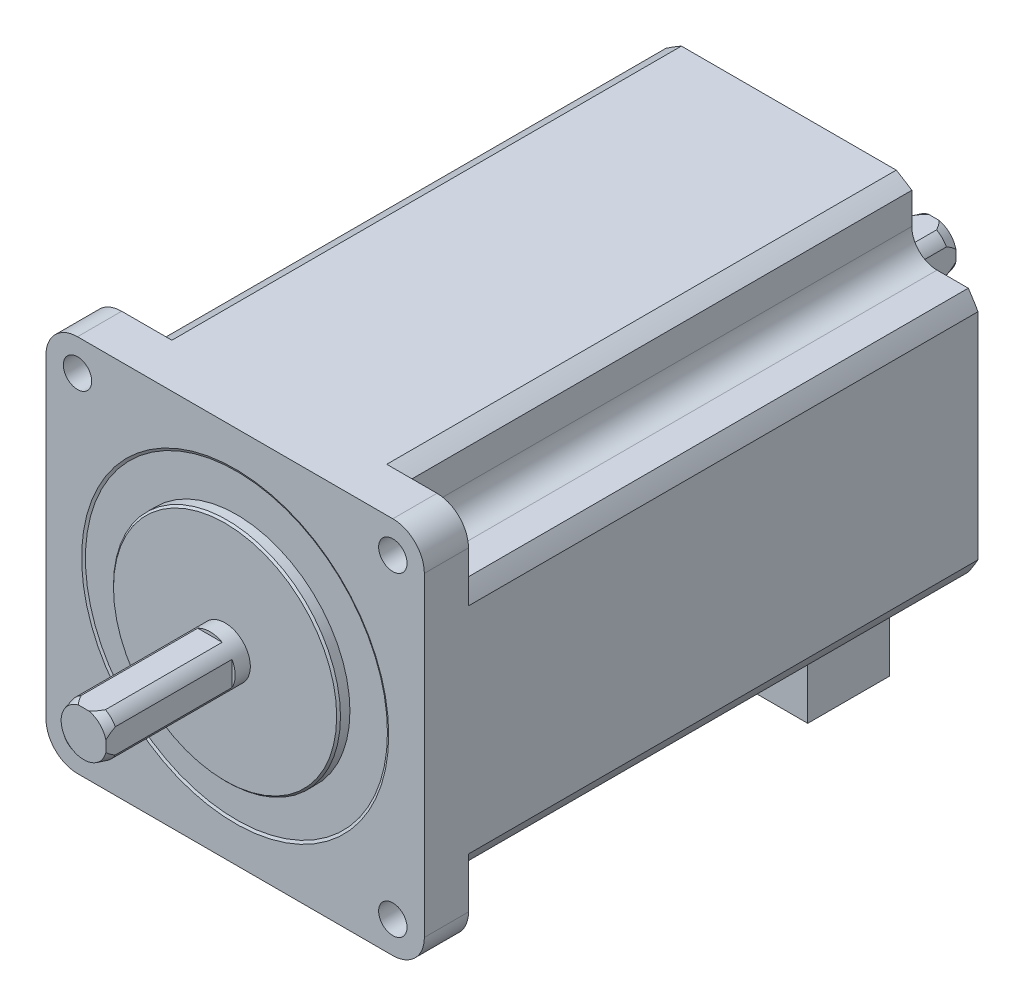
ISO-10303-21;
HEADER;
FILE_DESCRIPTION(('STEP AP214'),'2;1');
FILE_NAME('part.step','',(''),(''),'','','');
FILE_SCHEMA(('AUTOMOTIVE_DESIGN { 1 0 10303 214 1 1 1 1 }'));
ENDSEC;
DATA;
#1=APPLICATION_CONTEXT('core data for automotive mechanical design processes');
#2=APPLICATION_PROTOCOL_DEFINITION('international standard','automotive_design',2000,#1);
#3=PRODUCT_CONTEXT('',#1,'mechanical');
#4=PRODUCT('Part','Part','',(#3));
#5=PRODUCT_RELATED_PRODUCT_CATEGORY('part','',(#4));
#6=PRODUCT_DEFINITION_FORMATION('','',#4);
#7=PRODUCT_DEFINITION_CONTEXT('part definition',#1,'design');
#8=PRODUCT_DEFINITION('design','',#6,#7);
#9=PRODUCT_DEFINITION_SHAPE('','',#8);
#10=(LENGTH_UNIT() NAMED_UNIT(*) SI_UNIT(.MILLI.,.METRE.));
#11=(NAMED_UNIT(*) PLANE_ANGLE_UNIT() SI_UNIT($,.RADIAN.));
#12=(NAMED_UNIT(*) SI_UNIT($,.STERADIAN.) SOLID_ANGLE_UNIT());
#13=UNCERTAINTY_MEASURE_WITH_UNIT(LENGTH_MEASURE(1.E-05),#10,'distance_accuracy_value','');
#14=(GEOMETRIC_REPRESENTATION_CONTEXT(3) GLOBAL_UNCERTAINTY_ASSIGNED_CONTEXT((#13)) GLOBAL_UNIT_ASSIGNED_CONTEXT((#10,
#11,#12)) REPRESENTATION_CONTEXT('',''));
#15=CARTESIAN_POINT('',(0.,0.,0.));
#16=DIRECTION('',(0.,0.,1.));
#17=DIRECTION('',(1.,0.,0.));
#18=AXIS2_PLACEMENT_3D('',#15,#16,#17);
#19=CARTESIAN_POINT('',(0.,0.,-89.4));
#20=DIRECTION('',(0.,0.,-1.));
#21=DIRECTION('',(-1.,0.,0.));
#22=AXIS2_PLACEMENT_3D('',#19,#20,#21);
#23=PLANE('',#22);
#24=DIRECTION('',(0.,1.,0.));
#25=VECTOR('',#24,1.);
#26=CARTESIAN_POINT('',(-30.,0.,-89.4));
#27=LINE('',#26,#25);
#28=CARTESIAN_POINT('',(-30.,-17.0367250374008,-89.4));
#29=VERTEX_POINT('',#28);
#30=CARTESIAN_POINT('',(-30.,17.0367250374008,-89.4));
#31=VERTEX_POINT('',#30);
#32=EDGE_CURVE('E437',#29,#31,#27,.T.);
#33=ORIENTED_EDGE('',*,*,#32,.T.);
#34=CARTESIAN_POINT('',(0.,0.,-89.4));
#35=DIRECTION('',(0.,0.,-1.));
#36=DIRECTION('',(-1.,0.,0.));
#37=AXIS2_PLACEMENT_3D('',#34,#35,#36);
#38=CIRCLE('',#37,34.5);
#39=CARTESIAN_POINT('',(-28.4604989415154,19.5,-89.4));
#40=VERTEX_POINT('',#39);
#41=EDGE_CURVE('E440',#31,#40,#38,.T.);
#42=ORIENTED_EDGE('',*,*,#41,.T.);
#43=DIRECTION('',(-1.,0.,0.));
#44=VECTOR('',#43,1.);
#45=CARTESIAN_POINT('',(0.,19.5000000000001,-89.4));
#46=LINE('',#45,#44);
#47=CARTESIAN_POINT('',(-23.5,19.5,-89.4));
#48=VERTEX_POINT('',#47);
#49=EDGE_CURVE('E444',#48,#40,#46,.T.);
#50=ORIENTED_EDGE('',*,*,#49,.F.);
#51=CARTESIAN_POINT('',(-23.5,23.5,-89.4));
#52=DIRECTION('',(0.,0.,-1.));
#53=DIRECTION('',(-1.,0.,0.));
#54=AXIS2_PLACEMENT_3D('',#51,#52,#53);
#55=CIRCLE('',#54,4.);
#56=CARTESIAN_POINT('',(-19.5,23.5,-89.4));
#57=VERTEX_POINT('',#56);
#58=EDGE_CURVE('E568',#48,#57,#55,.F.);
#59=ORIENTED_EDGE('',*,*,#58,.T.);
#60=DIRECTION('',(0.,-1.,0.));
#61=VECTOR('',#60,1.);
#62=CARTESIAN_POINT('',(-19.5,0.,-89.4));
#63=LINE('',#62,#61);
#64=CARTESIAN_POINT('',(-19.5,28.4604989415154,-89.4));
#65=VERTEX_POINT('',#64);
#66=EDGE_CURVE('E448',#65,#57,#63,.T.);
#67=ORIENTED_EDGE('',*,*,#66,.F.);
#68=CARTESIAN_POINT('',(-17.0367250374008,30.,-89.4));
#69=VERTEX_POINT('',#68);
#70=EDGE_CURVE('E446',#65,#69,#38,.T.);
#71=ORIENTED_EDGE('',*,*,#70,.T.);
#72=DIRECTION('',(1.,0.,0.));
#73=VECTOR('',#72,1.);
#74=CARTESIAN_POINT('',(0.,30.,-89.4));
#75=LINE('',#74,#73);
#76=CARTESIAN_POINT('',(17.0367250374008,30.,-89.4));
#77=VERTEX_POINT('',#76);
#78=EDGE_CURVE('E451',#69,#77,#75,.T.);
#79=ORIENTED_EDGE('',*,*,#78,.T.);
#80=CARTESIAN_POINT('',(19.5,28.4604989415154,-89.4));
#81=VERTEX_POINT('',#80);
#82=EDGE_CURVE('E453',#77,#81,#38,.T.);
#83=ORIENTED_EDGE('',*,*,#82,.T.);
#84=DIRECTION('',(0.,-1.,0.));
#85=VECTOR('',#84,1.);
#86=CARTESIAN_POINT('',(19.5,0.,-89.4));
#87=LINE('',#86,#85);
#88=CARTESIAN_POINT('',(19.5,23.5,-89.4));
#89=VERTEX_POINT('',#88);
#90=EDGE_CURVE('E454',#81,#89,#87,.T.);
#91=ORIENTED_EDGE('',*,*,#90,.T.);
#92=CARTESIAN_POINT('',(23.5,23.5,-89.4));
#93=DIRECTION('',(0.,0.,-1.));
#94=DIRECTION('',(-1.,0.,0.));
#95=AXIS2_PLACEMENT_3D('',#92,#93,#94);
#96=CIRCLE('',#95,4.);
#97=CARTESIAN_POINT('',(23.5,19.5,-89.4));
#98=VERTEX_POINT('',#97);
#99=EDGE_CURVE('E570',#89,#98,#96,.F.);
#100=ORIENTED_EDGE('',*,*,#99,.T.);
#101=DIRECTION('',(-1.,0.,0.));
#102=VECTOR('',#101,1.);
#103=CARTESIAN_POINT('',(0.,19.5000000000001,-89.4));
#104=LINE('',#103,#102);
#105=CARTESIAN_POINT('',(28.4604989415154,19.5,-89.4));
#106=VERTEX_POINT('',#105);
#107=EDGE_CURVE('E457',#106,#98,#104,.T.);
#108=ORIENTED_EDGE('',*,*,#107,.F.);
#109=CARTESIAN_POINT('',(30.,17.0367250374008,-89.4));
#110=VERTEX_POINT('',#109);
#111=EDGE_CURVE('E460',#106,#110,#38,.T.);
#112=ORIENTED_EDGE('',*,*,#111,.T.);
#113=DIRECTION('',(0.,-1.,0.));
#114=VECTOR('',#113,1.);
#115=CARTESIAN_POINT('',(30.,0.,-89.4));
#116=LINE('',#115,#114);
#117=CARTESIAN_POINT('',(30.,-17.0367250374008,-89.4));
#118=VERTEX_POINT('',#117);
#119=EDGE_CURVE('E461',#110,#118,#116,.T.);
#120=ORIENTED_EDGE('',*,*,#119,.T.);
#121=CARTESIAN_POINT('',(28.4604989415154,-19.5,-89.4));
#122=VERTEX_POINT('',#121);
#123=EDGE_CURVE('E463',#118,#122,#38,.T.);
#124=ORIENTED_EDGE('',*,*,#123,.T.);
#125=DIRECTION('',(-1.,0.,0.));
#126=VECTOR('',#125,1.);
#127=CARTESIAN_POINT('',(0.,-19.4999999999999,-89.4));
#128=LINE('',#127,#126);
#129=CARTESIAN_POINT('',(23.5,-19.5,-89.4));
#130=VERTEX_POINT('',#129);
#131=EDGE_CURVE('E464',#122,#130,#128,.T.);
#132=ORIENTED_EDGE('',*,*,#131,.T.);
#133=CARTESIAN_POINT('',(23.5,-23.5,-89.4));
#134=DIRECTION('',(0.,0.,-1.));
#135=DIRECTION('',(-1.,0.,0.));
#136=AXIS2_PLACEMENT_3D('',#133,#134,#135);
#137=CIRCLE('',#136,4.);
#138=CARTESIAN_POINT('',(19.5,-23.5,-89.4));
#139=VERTEX_POINT('',#138);
#140=EDGE_CURVE('E564',#130,#139,#137,.F.);
#141=ORIENTED_EDGE('',*,*,#140,.T.);
#142=DIRECTION('',(0.,-1.,0.));
#143=VECTOR('',#142,1.);
#144=CARTESIAN_POINT('',(19.5,0.,-89.4));
#145=LINE('',#144,#143);
#146=CARTESIAN_POINT('',(19.5,-28.4604989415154,-89.4));
#147=VERTEX_POINT('',#146);
#148=EDGE_CURVE('E467',#139,#147,#145,.T.);
#149=ORIENTED_EDGE('',*,*,#148,.T.);
#150=CARTESIAN_POINT('',(17.0367250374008,-30.,-89.4));
#151=VERTEX_POINT('',#150);
#152=EDGE_CURVE('E469',#147,#151,#38,.T.);
#153=ORIENTED_EDGE('',*,*,#152,.T.);
#154=DIRECTION('',(-1.,0.,0.));
#155=VECTOR('',#154,1.);
#156=CARTESIAN_POINT('',(0.,-30.,-89.4));
#157=LINE('',#156,#155);
#158=CARTESIAN_POINT('',(16.,-30.,-89.4));
#159=VERTEX_POINT('',#158);
#160=EDGE_CURVE('E470',#151,#159,#157,.T.);
#161=ORIENTED_EDGE('',*,*,#160,.T.);
#162=DIRECTION('',(0.,1.,0.));
#163=VECTOR('',#162,1.);
#164=CARTESIAN_POINT('',(16.,-40.,-89.4));
#165=LINE('',#164,#163);
#166=CARTESIAN_POINT('',(16.,-40.,-89.4));
#167=VERTEX_POINT('',#166);
#168=EDGE_CURVE('E431',#167,#159,#165,.T.);
#169=ORIENTED_EDGE('',*,*,#168,.F.);
#170=DIRECTION('',(1.,0.,0.));
#171=VECTOR('',#170,1.);
#172=CARTESIAN_POINT('',(-16.,-40.,-89.4));
#173=LINE('',#172,#171);
#174=CARTESIAN_POINT('',(-16.,-40.,-89.4));
#175=VERTEX_POINT('',#174);
#176=EDGE_CURVE('E414',#175,#167,#173,.T.);
#177=ORIENTED_EDGE('',*,*,#176,.F.);
#178=DIRECTION('',(0.,1.,0.));
#179=VECTOR('',#178,1.);
#180=CARTESIAN_POINT('',(-16.,-40.,-89.4));
#181=LINE('',#180,#179);
#182=CARTESIAN_POINT('',(-16.,-30.,-89.4));
#183=VERTEX_POINT('',#182);
#184=EDGE_CURVE('E433',#175,#183,#181,.T.);
#185=ORIENTED_EDGE('',*,*,#184,.T.);
#186=CARTESIAN_POINT('',(-17.0367250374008,-30.,-89.4));
#187=VERTEX_POINT('',#186);
#188=EDGE_CURVE('E474',#183,#187,#157,.T.);
#189=ORIENTED_EDGE('',*,*,#188,.T.);
#190=CARTESIAN_POINT('',(-19.5,-28.4604989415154,-89.4));
#191=VERTEX_POINT('',#190);
#192=EDGE_CURVE('E473',#187,#191,#38,.T.);
#193=ORIENTED_EDGE('',*,*,#192,.T.);
#194=DIRECTION('',(0.,-1.,0.));
#195=VECTOR('',#194,1.);
#196=CARTESIAN_POINT('',(-19.5,0.,-89.4));
#197=LINE('',#196,#195);
#198=CARTESIAN_POINT('',(-19.5,-23.5,-89.4));
#199=VERTEX_POINT('',#198);
#200=EDGE_CURVE('E475',#199,#191,#197,.T.);
#201=ORIENTED_EDGE('',*,*,#200,.F.);
#202=CARTESIAN_POINT('',(-23.5,-23.5,-89.4));
#203=DIRECTION('',(0.,0.,-1.));
#204=DIRECTION('',(-1.,0.,0.));
#205=AXIS2_PLACEMENT_3D('',#202,#203,#204);
#206=CIRCLE('',#205,4.);
#207=CARTESIAN_POINT('',(-23.5,-19.5,-89.4));
#208=VERTEX_POINT('',#207);
#209=EDGE_CURVE('E566',#199,#208,#206,.F.);
#210=ORIENTED_EDGE('',*,*,#209,.T.);
#211=DIRECTION('',(-1.,0.,0.));
#212=VECTOR('',#211,1.);
#213=CARTESIAN_POINT('',(0.,-19.4999999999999,-89.4));
#214=LINE('',#213,#212);
#215=CARTESIAN_POINT('',(-28.4604989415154,-19.5,-89.4));
#216=VERTEX_POINT('',#215);
#217=EDGE_CURVE('E477',#208,#216,#214,.T.);
#218=ORIENTED_EDGE('',*,*,#217,.T.);
#219=EDGE_CURVE('E445',#216,#29,#38,.T.);
#220=ORIENTED_EDGE('',*,*,#219,.T.);
#221=EDGE_LOOP('',(#33,#42,#50,#59,#67,#71,#79,#83,#91,#100,#108,#112,#120,#124,#132,#141,#149,
#153,#161,#169,#177,#185,#189,#193,#201,#210,#218,#220));
#222=FACE_BOUND('',#221,.T.);
#223=CARTESIAN_POINT('',(0.,0.,-89.4));
#224=DIRECTION('',(0.,0.,-1.));
#225=DIRECTION('',(-1.,0.,0.));
#226=AXIS2_PLACEMENT_3D('',#223,#224,#225);
#227=CIRCLE('',#226,4.);
#228=CARTESIAN_POINT('',(-4.,0.,-89.4));
#229=VERTEX_POINT('',#228);
#230=EDGE_CURVE('E378',#229,#229,#227,.T.);
#231=ORIENTED_EDGE('',*,*,#230,.F.);
#232=EDGE_LOOP('',(#231));
#233=FACE_BOUND('',#232,.T.);
#234=ADVANCED_FACE('F39',(#222,#233),#23,.T.);
#235=CARTESIAN_POINT('',(0.,0.,22.4));
#236=DIRECTION('',(0.,0.,-1.));
#237=DIRECTION('',(-1.,0.,0.));
#238=AXIS2_PLACEMENT_3D('',#235,#236,#237);
#239=CONICAL_SURFACE('',#238,3.59807621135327,0.261799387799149);
#240=CARTESIAN_POINT('',(3.5,3.65885881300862,16.9316215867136));
#241=CARTESIAN_POINT('',(3.5,3.6023956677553,17.0838864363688));
#242=CARTESIAN_POINT('',(3.5,3.54539058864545,17.2359490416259));
#243=CARTESIAN_POINT('',(3.5,3.4301217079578,17.5396047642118));
#244=CARTESIAN_POINT('',(3.5,3.37185784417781,17.6911978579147));
#245=CARTESIAN_POINT('',(3.5,3.19466893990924,18.1458077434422));
#246=CARTESIAN_POINT('',(3.5,3.07358949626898,18.4479953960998));
#247=CARTESIAN_POINT('',(3.5,2.88202757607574,18.9085831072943));
#248=CARTESIAN_POINT('',(3.5,2.81435636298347,19.0681529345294));
#249=CARTESIAN_POINT('',(3.5,2.67631316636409,19.3861181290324));
#250=CARTESIAN_POINT('',(3.5,2.60594127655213,19.5445135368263));
#251=CARTESIAN_POINT('',(3.5,2.46196785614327,19.8596093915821));
#252=CARTESIAN_POINT('',(3.5,2.38837023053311,20.0163116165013));
#253=CARTESIAN_POINT('',(3.5,2.23702965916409,20.3276939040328));
#254=CARTESIAN_POINT('',(3.5,2.15928717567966,20.4823741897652));
#255=CARTESIAN_POINT('',(3.5,1.99956753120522,20.7867790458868));
#256=CARTESIAN_POINT('',(3.5,1.91766524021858,20.9365427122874));
#257=CARTESIAN_POINT('',(3.5,1.74677024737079,21.2323903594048));
#258=CARTESIAN_POINT('',(3.5,1.65776561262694,21.3784675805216));
#259=CARTESIAN_POINT('',(3.5,1.51770774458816,21.591674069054));
#260=CARTESIAN_POINT('',(3.5,1.47033809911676,21.6612195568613));
#261=CARTESIAN_POINT('',(3.5,1.37275172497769,21.7982748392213));
#262=CARTESIAN_POINT('',(3.5,1.32253564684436,21.8657850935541));
#263=CARTESIAN_POINT('',(3.5,1.21878037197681,21.9979192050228));
#264=CARTESIAN_POINT('',(3.5,1.16525083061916,22.0625505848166));
#265=CARTESIAN_POINT('',(3.5,1.05398107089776,22.1880495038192));
#266=CARTESIAN_POINT('',(3.5,0.996243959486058,22.2489197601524));
#267=CARTESIAN_POINT('',(3.5,0.879074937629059,22.3618808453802));
#268=CARTESIAN_POINT('',(3.5,0.819941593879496,22.4142773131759));
#269=CARTESIAN_POINT('',(3.5,0.69605087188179,22.5121419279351));
#270=CARTESIAN_POINT('',(3.5,0.631293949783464,22.557610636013));
#271=CARTESIAN_POINT('',(3.5,0.507273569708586,22.6311614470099));
#272=CARTESIAN_POINT('',(3.5,0.449006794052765,22.6608914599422));
#273=CARTESIAN_POINT('',(3.5,0.328412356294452,22.710540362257));
#274=CARTESIAN_POINT('',(3.5,0.266093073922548,22.7304788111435));
#275=CARTESIAN_POINT('',(3.5,0.149648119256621,22.7555691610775));
#276=CARTESIAN_POINT('',(3.5,0.0959490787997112,22.7626698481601));
#277=CARTESIAN_POINT('',(3.5,-0.0118697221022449,22.767496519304));
#278=CARTESIAN_POINT('',(3.5,-0.0659893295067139,22.7652257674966));
#279=CARTESIAN_POINT('',(3.5,-0.172879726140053,22.7516191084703));
#280=CARTESIAN_POINT('',(3.5,-0.225653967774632,22.7403094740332));
#281=CARTESIAN_POINT('',(3.5,-0.328872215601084,22.7098978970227));
#282=CARTESIAN_POINT('',(3.5,-0.37931467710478,22.6907908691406));
#283=CARTESIAN_POINT('',(3.5,-0.508714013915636,22.6321380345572));
#284=CARTESIAN_POINT('',(3.5,-0.585263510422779,22.5873371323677));
#285=CARTESIAN_POINT('',(3.5,-0.730938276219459,22.4869137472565));
#286=CARTESIAN_POINT('',(3.5,-0.800033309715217,22.4312495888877));
#287=CARTESIAN_POINT('',(3.5,-0.955746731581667,22.2916879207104));
#288=CARTESIAN_POINT('',(3.5,-1.0396891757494,22.204851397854));
#289=CARTESIAN_POINT('',(3.5,-1.19908801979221,22.0236161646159));
#290=CARTESIAN_POINT('',(3.5,-1.27452504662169,21.9292009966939));
#291=CARTESIAN_POINT('',(3.5,-1.41979524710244,21.7344953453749));
#292=CARTESIAN_POINT('',(3.5,-1.48955344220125,21.6341495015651));
#293=CARTESIAN_POINT('',(3.5,-1.62395149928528,21.4302869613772));
#294=CARTESIAN_POINT('',(3.5,-1.68859694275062,21.326773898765));
#295=CARTESIAN_POINT('',(3.5,-1.85613404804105,21.0470251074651));
#296=CARTESIAN_POINT('',(3.5,-1.95551266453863,20.8686941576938));
#297=CARTESIAN_POINT('',(3.5,-2.14665533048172,20.5079710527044));
#298=CARTESIAN_POINT('',(3.5,-2.23841606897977,20.3255771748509));
#299=CARTESIAN_POINT('',(3.5,-2.41645935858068,19.9576498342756));
#300=CARTESIAN_POINT('',(3.5,-2.50272932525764,19.7721103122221));
#301=CARTESIAN_POINT('',(3.5,-2.67090131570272,19.3990599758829));
#302=CARTESIAN_POINT('',(3.5,-2.75280305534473,19.2115490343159));
#303=CARTESIAN_POINT('',(3.5,-2.90658898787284,18.8504519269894));
#304=CARTESIAN_POINT('',(3.5,-2.97874468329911,18.6769809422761));
#305=CARTESIAN_POINT('',(3.5,-3.12065566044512,18.3290502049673));
#306=CARTESIAN_POINT('',(3.5,-3.19041080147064,18.1545903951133));
#307=CARTESIAN_POINT('',(3.5,-3.32757858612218,17.805733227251));
#308=CARTESIAN_POINT('',(3.5,-3.39500096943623,17.6313396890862));
#309=CARTESIAN_POINT('',(3.5,-3.52813716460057,17.2819241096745));
#310=CARTESIAN_POINT('',(3.5,-3.59385117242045,17.1069021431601));
#311=CARTESIAN_POINT('',(3.5,-3.65885881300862,16.9316215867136));
#312=B_SPLINE_CURVE_WITH_KNOTS('',3,(#240,#241,#242,#243,#244,#245,#246,#247,#248,#249,#250,
#251,#252,#253,#254,#255,#256,#257,#258,#259,#260,#261,#262,#263,#264,#265,#266,#267,#268,#269,
#270,#271,#272,#273,#274,#275,#276,#277,#278,#279,#280,#281,#282,#283,#284,#285,#286,#287,#288,
#289,#290,#291,#292,#293,#294,#295,#296,#297,#298,#299,#300,#301,#302,#303,#304,#305,#306,#307,
#308,#309,#310,#311),.UNSPECIFIED.,.F.,.F.,(4,2,2,2,2,2,2,2,2,2,2,2,2,2,2,2,2,2,2,2,2,2,2,2,2,2,
2,2,2,2,2,2,2,2,2,4),(0.,0.487185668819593,0.974395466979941,1.95092394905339,2.47088362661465,
2.99082527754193,3.51015400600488,4.02942493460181,4.54139798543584,5.0542501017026,
5.30663191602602,5.55895628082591,5.81057715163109,6.06201406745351,6.29868754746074,
6.5353418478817,6.73093008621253,6.92612601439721,7.08786234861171,7.2495423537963,
7.41075411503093,7.57207118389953,7.83661046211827,8.10218530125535,8.46361083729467,
8.82584364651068,9.19226963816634,9.55828992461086,10.1704387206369,10.7828521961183,
11.3966221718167,12.0104320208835,12.574048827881,13.1376986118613,13.6986081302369,
14.259453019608),.UNSPECIFIED.);
#313=CARTESIAN_POINT('',(3.5,1.93649167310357,20.9000000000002));
#314=VERTEX_POINT('',#313);
#315=CARTESIAN_POINT('',(3.5,0.834357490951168,22.4));
#316=VERTEX_POINT('',#315);
#317=EDGE_CURVE('E1505',#314,#316,#312,.T.);
#318=ORIENTED_EDGE('',*,*,#317,.F.);
#319=CARTESIAN_POINT('',(0.,0.,20.8999999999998));
#320=DIRECTION('',(0.,0.,1.));
#321=DIRECTION('',(1.,0.,0.));
#322=AXIS2_PLACEMENT_3D('',#319,#320,#321);
#323=CIRCLE('',#322,4.);
#324=CARTESIAN_POINT('',(1.93649167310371,3.5,20.8999999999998));
#325=VERTEX_POINT('',#324);
#326=EDGE_CURVE('E577',#325,#314,#323,.F.);
#327=ORIENTED_EDGE('',*,*,#326,.F.);
#328=CARTESIAN_POINT('',(-3.86930929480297,3.5,16.3564970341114));
#329=CARTESIAN_POINT('',(-3.81130684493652,3.5,16.5170199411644));
#330=CARTESIAN_POINT('',(-3.75279353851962,3.5,16.6773588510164));
#331=CARTESIAN_POINT('',(-3.63458077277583,3.5,16.9976052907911));
#332=CARTESIAN_POINT('',(-3.57488126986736,3.5,17.1575128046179));
#333=CARTESIAN_POINT('',(-3.39361030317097,3.5,17.6368798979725));
#334=CARTESIAN_POINT('',(-3.27001249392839,3.5,17.9555770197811));
#335=CARTESIAN_POINT('',(-3.01244232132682,3.5,18.5978750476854));
#336=CARTESIAN_POINT('',(-2.87828989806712,3.5,18.9214046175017));
#337=CARTESIAN_POINT('',(-2.66885480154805,3.5,19.4030223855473));
#338=CARTESIAN_POINT('',(-2.5976976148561,3.5,19.5629021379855));
#339=CARTESIAN_POINT('',(-2.4519712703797,3.5,19.8810939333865));
#340=CARTESIAN_POINT('',(-2.37740232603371,3.5,20.039406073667));
#341=CARTESIAN_POINT('',(-2.22441816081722,3.5,20.3530265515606));
#342=CARTESIAN_POINT('',(-2.14602805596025,3.5,20.5083470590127));
#343=CARTESIAN_POINT('',(-1.98368792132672,3.5,20.8162072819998));
#344=CARTESIAN_POINT('',(-1.89973412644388,3.5,20.9687450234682));
#345=CARTESIAN_POINT('',(-1.72475802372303,3.5,21.269028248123));
#346=CARTESIAN_POINT('',(-1.6337634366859,3.5,21.4167895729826));
#347=CARTESIAN_POINT('',(-1.48957033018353,3.5,21.6332031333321));
#348=CARTESIAN_POINT('',(-1.44025385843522,3.5,21.7044290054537));
#349=CARTESIAN_POINT('',(-1.33846826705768,3.5,21.8445807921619));
#350=CARTESIAN_POINT('',(-1.28599919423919,3.5,21.9135067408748));
#351=CARTESIAN_POINT('',(-1.15028154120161,3.5,22.0816859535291));
#352=CARTESIAN_POINT('',(-1.06463830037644,3.5,22.179089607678));
#353=CARTESIAN_POINT('',(-0.927427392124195,3.5,22.3162128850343));
#354=CARTESIAN_POINT('',(-0.880306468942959,3.5,22.3603667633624));
#355=CARTESIAN_POINT('',(-0.782611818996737,3.5,22.4446415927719));
#356=CARTESIAN_POINT('',(-0.732041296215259,3.5,22.4847662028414));
#357=CARTESIAN_POINT('',(-0.626326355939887,3.5,22.5599557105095));
#358=CARTESIAN_POINT('',(-0.57113622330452,3.5,22.5949574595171));
#359=CARTESIAN_POINT('',(-0.456439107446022,3.5,22.6571140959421));
#360=CARTESIAN_POINT('',(-0.396936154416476,3.5,22.6842761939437));
#361=CARTESIAN_POINT('',(-0.282931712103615,3.5,22.7248685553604));
#362=CARTESIAN_POINT('',(-0.228944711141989,3.5,22.739713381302));
#363=CARTESIAN_POINT('',(-0.119250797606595,3.5,22.7600378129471));
#364=CARTESIAN_POINT('',(-0.0635463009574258,3.5,22.7655300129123));
#365=CARTESIAN_POINT('',(0.0480719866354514,3.5,22.7664569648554));
#366=CARTESIAN_POINT('',(0.103985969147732,3.5,22.7618697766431));
#367=CARTESIAN_POINT('',(0.214216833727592,3.5,22.7432034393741));
#368=CARTESIAN_POINT('',(0.268531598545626,3.5,22.7291122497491));
#369=CARTESIAN_POINT('',(0.392914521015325,3.5,22.6866590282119));
#370=CARTESIAN_POINT('',(0.46184869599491,3.5,22.655029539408));
#371=CARTESIAN_POINT('',(0.593979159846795,3.5,22.5815220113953));
#372=CARTESIAN_POINT('',(0.657160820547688,3.5,22.5396187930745));
#373=CARTESIAN_POINT('',(0.775505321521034,3.5,22.4508929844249));
#374=CARTESIAN_POINT('',(0.830900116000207,3.5,22.4043731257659));
#375=CARTESIAN_POINT('',(0.937609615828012,3.5,22.3068263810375));
#376=CARTESIAN_POINT('',(0.988920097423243,3.5,22.2557949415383));
#377=CARTESIAN_POINT('',(1.08824660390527,3.5,22.1503476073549));
#378=CARTESIAN_POINT('',(1.13625167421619,3.5,22.095921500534));
#379=CARTESIAN_POINT('',(1.22933749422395,3.5,21.9846920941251));
#380=CARTESIAN_POINT('',(1.27441975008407,3.5,21.9278900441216));
#381=CARTESIAN_POINT('',(1.40470096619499,3.5,21.7565363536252));
#382=CARTESIAN_POINT('',(1.48644178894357,3.5,21.639361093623));
#383=CARTESIAN_POINT('',(1.64319201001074,3.5,21.4005598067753));
#384=CARTESIAN_POINT('',(1.71819627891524,3.5,21.2789304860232));
#385=CARTESIAN_POINT('',(1.86323185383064,3.5,21.0323940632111));
#386=CARTESIAN_POINT('',(1.93325170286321,3.5,20.9074802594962));
#387=CARTESIAN_POINT('',(2.06928175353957,3.5,20.6554785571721));
#388=CARTESIAN_POINT('',(2.13529130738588,3.5,20.5283903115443));
#389=CARTESIAN_POINT('',(2.26442116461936,3.5,20.2719514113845));
#390=CARTESIAN_POINT('',(2.32752509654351,3.5,20.1425925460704));
#391=CARTESIAN_POINT('',(2.45107743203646,3.5,19.8826099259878));
#392=CARTESIAN_POINT('',(2.51152569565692,3.5,19.7519861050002));
#393=CARTESIAN_POINT('',(2.68941804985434,3.5,19.358992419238));
#394=CARTESIAN_POINT('',(2.80358743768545,3.5,19.0951401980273));
#395=CARTESIAN_POINT('',(3.00048591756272,3.5,18.6248626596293));
#396=CARTESIAN_POINT('',(3.0844809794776,3.5,18.4189605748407));
#397=CARTESIAN_POINT('',(3.24945704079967,3.5,18.0058641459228));
#398=CARTESIAN_POINT('',(3.33043691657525,3.5,17.7986693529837));
#399=CARTESIAN_POINT('',(3.48887984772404,3.5,17.3860176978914));
#400=CARTESIAN_POINT('',(3.56637485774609,3.5,17.1805730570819));
#401=CARTESIAN_POINT('',(3.71929183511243,3.5,16.7690161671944));
#402=CARTESIAN_POINT('',(3.79471470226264,3.5,16.5629042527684));
#403=CARTESIAN_POINT('',(3.86930929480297,3.5,16.3564970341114));
#404=B_SPLINE_CURVE_WITH_KNOTS('',3,(#328,#329,#330,#331,#332,#333,#334,#335,#336,#337,#338,
#339,#340,#341,#342,#343,#344,#345,#346,#347,#348,#349,#350,#351,#352,#353,#354,#355,#356,#357,
#358,#359,#360,#361,#362,#363,#364,#365,#366,#367,#368,#369,#370,#371,#372,#373,#374,#375,#376,
#377,#378,#379,#380,#381,#382,#383,#384,#385,#386,#387,#388,#389,#390,#391,#392,#393,#394,#395,
#396,#397,#398,#399,#400,#401,#402,#403),.UNSPECIFIED.,.F.,.F.,(4,2,2,2,2,2,2,2,2,2,2,2,2,2,2,2,
2,2,2,2,2,2,2,2,2,2,2,2,2,2,2,2,2,2,2,2,2,4),(0.,0.512041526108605,1.02410189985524,
2.04951981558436,3.10007779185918,3.62504636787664,4.1499821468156,4.67184000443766,
5.1940546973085,5.71430882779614,5.97412878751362,6.23394489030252,6.62218502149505,
6.8157513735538,7.00914032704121,7.20474211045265,7.40016340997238,7.56743042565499,
7.73447202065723,7.90187758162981,8.06949562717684,8.29573563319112,8.52253575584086,
8.73922123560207,8.95612796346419,9.17372201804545,9.39120303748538,9.81942658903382,
10.2479734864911,10.6774755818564,11.1070468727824,11.5387992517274,11.9705743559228,
12.8329204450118,13.5000255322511,14.1673767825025,14.8260894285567,15.4845113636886),.UNSPECIFIED.);
#405=CARTESIAN_POINT('',(0.834357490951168,3.5,22.4));
#406=VERTEX_POINT('',#405);
#407=EDGE_CURVE('E580',#406,#325,#404,.T.);
#408=ORIENTED_EDGE('',*,*,#407,.F.);
#409=CARTESIAN_POINT('',(0.,0.,22.4));
#410=DIRECTION('',(0.,0.,1.));
#411=DIRECTION('',(1.,0.,0.));
#412=AXIS2_PLACEMENT_3D('',#409,#410,#411);
#413=CIRCLE('',#412,3.59807621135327);
#414=EDGE_CURVE('E572',#316,#406,#413,.T.);
#415=ORIENTED_EDGE('',*,*,#414,.F.);
#416=EDGE_LOOP('',(#318,#327,#408,#415));
#417=FACE_BOUND('',#416,.T.);
#418=ADVANCED_FACE('F625',(#417),#239,.T.);
#419=CARTESIAN_POINT('',(0.,0.,22.4));
#420=DIRECTION('',(0.,0.,-1.));
#421=DIRECTION('',(-1.,0.,0.));
#422=AXIS2_PLACEMENT_3D('',#419,#420,#421);
#423=CYLINDRICAL_SURFACE('',#422,4.);
#424=ORIENTED_EDGE('',*,*,#326,.T.);
#425=DIRECTION('',(0.,0.,-1.));
#426=VECTOR('',#425,1.);
#427=CARTESIAN_POINT('',(3.5,1.93649167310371,22.4));
#428=LINE('',#427,#426);
#429=CARTESIAN_POINT('',(3.5,1.93649167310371,2.4));
#430=VERTEX_POINT('',#429);
#431=EDGE_CURVE('E395',#314,#430,#428,.T.);
#432=ORIENTED_EDGE('',*,*,#431,.T.);
#433=CARTESIAN_POINT('',(0.,0.,2.4));
#434=DIRECTION('',(0.,0.,-1.));
#435=DIRECTION('',(-1.,0.,0.));
#436=AXIS2_PLACEMENT_3D('',#433,#434,#435);
#437=CIRCLE('',#436,4.);
#438=CARTESIAN_POINT('',(3.5,-1.93649167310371,2.4));
#439=VERTEX_POINT('',#438);
#440=EDGE_CURVE('E1506',#430,#439,#437,.T.);
#441=ORIENTED_EDGE('',*,*,#440,.T.);
#442=DIRECTION('',(0.,0.,-1.));
#443=VECTOR('',#442,1.);
#444=CARTESIAN_POINT('',(3.5,-1.93649167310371,22.4));
#445=LINE('',#444,#443);
#446=CARTESIAN_POINT('',(3.5,-1.93649167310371,20.8999999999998));
#447=VERTEX_POINT('',#446);
#448=EDGE_CURVE('E391',#439,#447,#445,.F.);
#449=ORIENTED_EDGE('',*,*,#448,.T.);
#450=CARTESIAN_POINT('',(-1.93649167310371,3.5,20.8999999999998));
#451=VERTEX_POINT('',#450);
#452=EDGE_CURVE('E576',#447,#451,#323,.F.);
#453=ORIENTED_EDGE('',*,*,#452,.T.);
#454=DIRECTION('',(0.,0.,-1.));
#455=VECTOR('',#454,1.);
#456=CARTESIAN_POINT('',(-1.93649167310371,3.5,22.4));
#457=LINE('',#456,#455);
#458=CARTESIAN_POINT('',(-1.93649167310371,3.5,2.4));
#459=VERTEX_POINT('',#458);
#460=EDGE_CURVE('E407',#451,#459,#457,.T.);
#461=ORIENTED_EDGE('',*,*,#460,.T.);
#462=CARTESIAN_POINT('',(0.,0.,2.4));
#463=DIRECTION('',(0.,0.,1.));
#464=DIRECTION('',(1.,0.,0.));
#465=AXIS2_PLACEMENT_3D('',#462,#463,#464);
#466=CIRCLE('',#465,4.);
#467=CARTESIAN_POINT('',(1.93649167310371,3.5,2.4));
#468=VERTEX_POINT('',#467);
#469=EDGE_CURVE('E588',#468,#459,#466,.T.);
#470=ORIENTED_EDGE('',*,*,#469,.F.);
#471=DIRECTION('',(0.,0.,-1.));
#472=VECTOR('',#471,1.);
#473=CARTESIAN_POINT('',(1.93649167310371,3.5,22.4));
#474=LINE('',#473,#472);
#475=EDGE_CURVE('E402',#468,#325,#474,.F.);
#476=ORIENTED_EDGE('',*,*,#475,.T.);
#477=EDGE_LOOP('',(#424,#432,#441,#449,#453,#461,#470,#476));
#478=FACE_BOUND('',#477,.T.);
#479=CARTESIAN_POINT('',(0.,0.,0.));
#480=DIRECTION('',(0.,0.,-1.));
#481=DIRECTION('',(-1.,0.,0.));
#482=AXIS2_PLACEMENT_3D('',#479,#480,#481);
#483=CIRCLE('',#482,4.);
#484=CARTESIAN_POINT('',(-4.,0.,0.));
#485=VERTEX_POINT('',#484);
#486=EDGE_CURVE('E878',#485,#485,#483,.T.);
#487=ORIENTED_EDGE('',*,*,#486,.F.);
#488=EDGE_LOOP('',(#487));
#489=FACE_BOUND('',#488,.T.);
#490=ADVANCED_FACE('F728',(#478,#489),#423,.T.);
#491=CARTESIAN_POINT('',(0.,0.,22.4));
#492=DIRECTION('',(0.,0.,1.));
#493=DIRECTION('',(1.,0.,0.));
#494=AXIS2_PLACEMENT_3D('',#491,#492,#493);
#495=PLANE('',#494);
#496=DIRECTION('',(0.,-1.,0.));
#497=VECTOR('',#496,1.);
#498=CARTESIAN_POINT('',(3.5,2.44128177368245,22.4));
#499=LINE('',#498,#497);
#500=CARTESIAN_POINT('',(3.5,-0.834357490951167,22.4));
#501=VERTEX_POINT('',#500);
#502=EDGE_CURVE('E387',#316,#501,#499,.T.);
#503=ORIENTED_EDGE('',*,*,#502,.F.);
#504=ORIENTED_EDGE('',*,*,#414,.T.);
#505=DIRECTION('',(1.,0.,0.));
#506=VECTOR('',#505,1.);
#507=CARTESIAN_POINT('',(-4.72781232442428,3.5,22.4));
#508=LINE('',#507,#506);
#509=CARTESIAN_POINT('',(-0.834357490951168,3.5,22.4));
#510=VERTEX_POINT('',#509);
#511=EDGE_CURVE('E398',#510,#406,#508,.T.);
#512=ORIENTED_EDGE('',*,*,#511,.F.);
#513=EDGE_CURVE('E573',#510,#501,#413,.T.);
#514=ORIENTED_EDGE('',*,*,#513,.T.);
#515=EDGE_LOOP('',(#503,#504,#512,#514));
#516=FACE_BOUND('',#515,.T.);
#517=ADVANCED_FACE('F721',(#516),#495,.T.);
#518=CARTESIAN_POINT('',(0.,0.,0.));
#519=DIRECTION('',(0.,0.,-1.));
#520=DIRECTION('',(-1.,0.,0.));
#521=AXIS2_PLACEMENT_3D('',#518,#519,#520);
#522=PLANE('',#521);
#523=CARTESIAN_POINT('',(0.,0.,0.));
#524=DIRECTION('',(0.,0.,-1.));
#525=DIRECTION('',(-1.,0.,0.));
#526=AXIS2_PLACEMENT_3D('',#523,#524,#525);
#527=CIRCLE('',#526,17.7);
#528=CARTESIAN_POINT('',(-17.7,0.,0.));
#529=VERTEX_POINT('',#528);
#530=EDGE_CURVE('E1512',#529,#529,#527,.F.);
#531=ORIENTED_EDGE('',*,*,#530,.T.);
#532=EDGE_LOOP('',(#531));
#533=FACE_BOUND('',#532,.T.);
#534=ORIENTED_EDGE('',*,*,#486,.T.);
#535=EDGE_LOOP('',(#534));
#536=FACE_BOUND('',#535,.T.);
#537=ADVANCED_FACE('F717',(#533,#536),#522,.F.);
#538=CARTESIAN_POINT('',(0.,0.,-1.6));
#539=DIRECTION('',(0.,0.,1.));
#540=DIRECTION('',(1.,0.,0.));
#541=AXIS2_PLACEMENT_3D('',#538,#539,#540);
#542=CYLINDRICAL_SURFACE('',#541,18.);
#543=CARTESIAN_POINT('',(0.,0.,-0.300000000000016));
#544=DIRECTION('',(0.,0.,-1.));
#545=DIRECTION('',(-1.,0.,0.));
#546=AXIS2_PLACEMENT_3D('',#543,#544,#545);
#547=CIRCLE('',#546,18.);
#548=CARTESIAN_POINT('',(-18.,0.,-0.300000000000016));
#549=VERTEX_POINT('',#548);
#550=EDGE_CURVE('E1509',#549,#549,#547,.T.);
#551=ORIENTED_EDGE('',*,*,#550,.T.);
#552=EDGE_LOOP('',(#551));
#553=FACE_BOUND('',#552,.T.);
#554=CARTESIAN_POINT('',(0.,0.,-1.8));
#555=DIRECTION('',(0.,0.,1.));
#556=DIRECTION('',(1.,0.,0.));
#557=AXIS2_PLACEMENT_3D('',#554,#555,#556);
#558=CIRCLE('',#557,18.);
#559=CARTESIAN_POINT('',(18.,0.,-1.8));
#560=VERTEX_POINT('',#559);
#561=EDGE_CURVE('E381',#560,#560,#558,.T.);
#562=ORIENTED_EDGE('',*,*,#561,.T.);
#563=EDGE_LOOP('',(#562));
#564=FACE_BOUND('',#563,.T.);
#565=ADVANCED_FACE('F720',(#553,#564),#542,.T.);
#566=EDGE_CURVE('E1500',#501,#447,#312,.T.);
#567=ORIENTED_EDGE('',*,*,#566,.F.);
#568=ORIENTED_EDGE('',*,*,#513,.F.);
#569=EDGE_CURVE('E587',#451,#510,#404,.T.);
#570=ORIENTED_EDGE('',*,*,#569,.F.);
#571=ORIENTED_EDGE('',*,*,#452,.F.);
#572=EDGE_LOOP('',(#567,#568,#570,#571));
#573=FACE_BOUND('',#572,.T.);
#574=ADVANCED_FACE('F590',(#573),#239,.T.);
#575=CARTESIAN_POINT('',(0.,0.,2.4));
#576=DIRECTION('',(0.,0.,1.));
#577=DIRECTION('',(1.,0.,0.));
#578=AXIS2_PLACEMENT_3D('',#575,#576,#577);
#579=PLANE('',#578);
#580=ORIENTED_EDGE('',*,*,#469,.T.);
#581=DIRECTION('',(1.,0.,0.));
#582=VECTOR('',#581,1.);
#583=CARTESIAN_POINT('',(-4.72781232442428,3.5,2.4));
#584=LINE('',#583,#582);
#585=EDGE_CURVE('E399',#459,#468,#584,.T.);
#586=ORIENTED_EDGE('',*,*,#585,.T.);
#587=EDGE_LOOP('',(#580,#586));
#588=FACE_BOUND('',#587,.T.);
#589=ADVANCED_FACE('F600',(#588),#579,.T.);
#590=CARTESIAN_POINT('',(-4.72781232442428,3.5,2.4));
#591=DIRECTION('',(0.,-1.,0.));
#592=DIRECTION('',(0.,0.,-1.));
#593=AXIS2_PLACEMENT_3D('',#590,#591,#592);
#594=PLANE('',#593);
#595=ORIENTED_EDGE('',*,*,#569,.T.);
#596=ORIENTED_EDGE('',*,*,#511,.T.);
#597=ORIENTED_EDGE('',*,*,#407,.T.);
#598=ORIENTED_EDGE('',*,*,#475,.F.);
#599=ORIENTED_EDGE('',*,*,#585,.F.);
#600=ORIENTED_EDGE('',*,*,#460,.F.);
#601=EDGE_LOOP('',(#595,#596,#597,#598,#599,#600));
#602=FACE_BOUND('',#601,.T.);
#603=ADVANCED_FACE('F594',(#602),#594,.F.);
#604=CARTESIAN_POINT('',(0.,0.,2.4));
#605=DIRECTION('',(0.,0.,-1.));
#606=DIRECTION('',(-1.,0.,0.));
#607=AXIS2_PLACEMENT_3D('',#604,#605,#606);
#608=PLANE('',#607);
#609=DIRECTION('',(0.,-1.,0.));
#610=VECTOR('',#609,1.);
#611=CARTESIAN_POINT('',(3.5,2.44128177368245,2.4));
#612=LINE('',#611,#610);
#613=EDGE_CURVE('E388',#430,#439,#612,.T.);
#614=ORIENTED_EDGE('',*,*,#613,.T.);
#615=ORIENTED_EDGE('',*,*,#440,.F.);
#616=EDGE_LOOP('',(#614,#615));
#617=FACE_BOUND('',#616,.T.);
#618=ADVANCED_FACE('F599',(#617),#608,.F.);
#619=CARTESIAN_POINT('',(3.5,2.44128177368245,2.4));
#620=DIRECTION('',(-1.,0.,0.));
#621=DIRECTION('',(0.,-1.,0.));
#622=AXIS2_PLACEMENT_3D('',#619,#620,#621);
#623=PLANE('',#622);
#624=ORIENTED_EDGE('',*,*,#317,.T.);
#625=ORIENTED_EDGE('',*,*,#502,.T.);
#626=ORIENTED_EDGE('',*,*,#566,.T.);
#627=ORIENTED_EDGE('',*,*,#448,.F.);
#628=ORIENTED_EDGE('',*,*,#613,.F.);
#629=ORIENTED_EDGE('',*,*,#431,.F.);
#630=EDGE_LOOP('',(#624,#625,#626,#627,#628,#629));
#631=FACE_BOUND('',#630,.T.);
#632=ADVANCED_FACE('F1081',(#631),#623,.F.);
#633=CARTESIAN_POINT('',(0.,0.,-0.300000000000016));
#634=DIRECTION('',(0.,0.,-1.));
#635=DIRECTION('',(-1.,0.,0.));
#636=AXIS2_PLACEMENT_3D('',#633,#634,#635);
#637=CONICAL_SURFACE('',#636,18.,0.785398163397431);
#638=ORIENTED_EDGE('',*,*,#530,.F.);
#639=EDGE_LOOP('',(#638));
#640=FACE_BOUND('',#639,.T.);
#641=ORIENTED_EDGE('',*,*,#550,.F.);
#642=EDGE_LOOP('',(#641));
#643=FACE_BOUND('',#642,.T.);
#644=ADVANCED_FACE('F1090',(#640,#643),#637,.T.);
#645=CARTESIAN_POINT('',(0.,0.,-1.8));
#646=DIRECTION('',(0.,0.,1.));
#647=DIRECTION('',(1.,0.,0.));
#648=AXIS2_PLACEMENT_3D('',#645,#646,#647);
#649=PLANE('',#648);
#650=CARTESIAN_POINT('',(0.,0.,-1.8));
#651=DIRECTION('',(0.,0.,1.));
#652=DIRECTION('',(1.,0.,0.));
#653=AXIS2_PLACEMENT_3D('',#650,#651,#652);
#654=CIRCLE('',#653,23.95);
#655=CARTESIAN_POINT('',(23.95,0.,-1.8));
#656=VERTEX_POINT('',#655);
#657=EDGE_CURVE('E1515',#656,#656,#654,.T.);
#658=ORIENTED_EDGE('',*,*,#657,.T.);
#659=EDGE_LOOP('',(#658));
#660=FACE_BOUND('',#659,.T.);
#661=ORIENTED_EDGE('',*,*,#561,.F.);
#662=EDGE_LOOP('',(#661));
#663=FACE_BOUND('',#662,.T.);
#664=ADVANCED_FACE('F638',(#660,#663),#649,.T.);
#665=CARTESIAN_POINT('',(0.,-19.4999999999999,-89.4));
#666=DIRECTION('',(0.,1.,0.));
#667=DIRECTION('',(-1.,0.,0.));
#668=AXIS2_PLACEMENT_3D('',#665,#666,#667);
#669=PLANE('',#668);
#670=ORIENTED_EDGE('',*,*,#217,.F.);
#671=DIRECTION('',(0.,0.,1.));
#672=VECTOR('',#671,1.);
#673=CARTESIAN_POINT('',(-23.5,-19.5,-89.4));
#674=LINE('',#673,#672);
#675=CARTESIAN_POINT('',(-23.5,-19.5,-8.6));
#676=VERTEX_POINT('',#675);
#677=EDGE_CURVE('E543',#208,#676,#674,.T.);
#678=ORIENTED_EDGE('',*,*,#677,.T.);
#679=DIRECTION('',(-1.,0.,0.));
#680=VECTOR('',#679,1.);
#681=CARTESIAN_POINT('',(0.,-19.4999999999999,-8.6));
#682=LINE('',#681,#680);
#683=CARTESIAN_POINT('',(-28.4604989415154,-19.5,-8.6));
#684=VERTEX_POINT('',#683);
#685=EDGE_CURVE('E801',#676,#684,#682,.T.);
#686=ORIENTED_EDGE('',*,*,#685,.T.);
#687=DIRECTION('',(0.,0.,1.));
#688=VECTOR('',#687,1.);
#689=CARTESIAN_POINT('',(-28.4604989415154,-19.5,-89.4));
#690=LINE('',#689,#688);
#691=EDGE_CURVE('E788',#216,#684,#690,.T.);
#692=ORIENTED_EDGE('',*,*,#691,.F.);
#693=EDGE_LOOP('',(#670,#678,#686,#692));
#694=FACE_BOUND('',#693,.T.);
#695=ADVANCED_FACE('F634',(#694),#669,.F.);
#696=CARTESIAN_POINT('',(-23.5,-23.5,-89.4));
#697=DIRECTION('',(0.,0.,1.));
#698=DIRECTION('',(1.,0.,0.));
#699=AXIS2_PLACEMENT_3D('',#696,#697,#698);
#700=CYLINDRICAL_SURFACE('',#699,4.);
#701=ORIENTED_EDGE('',*,*,#209,.F.);
#702=DIRECTION('',(0.,0.,1.));
#703=VECTOR('',#702,1.);
#704=CARTESIAN_POINT('',(-19.5,-23.5,-89.4));
#705=LINE('',#704,#703);
#706=CARTESIAN_POINT('',(-19.5,-23.5,-8.6));
#707=VERTEX_POINT('',#706);
#708=EDGE_CURVE('E548',#707,#199,#705,.F.);
#709=ORIENTED_EDGE('',*,*,#708,.F.);
#710=CARTESIAN_POINT('',(-23.5,-23.5,-8.6));
#711=DIRECTION('',(0.,0.,-1.));
#712=DIRECTION('',(-1.,0.,0.));
#713=AXIS2_PLACEMENT_3D('',#710,#711,#712);
#714=CIRCLE('',#713,4.);
#715=EDGE_CURVE('E546',#676,#707,#714,.T.);
#716=ORIENTED_EDGE('',*,*,#715,.F.);
#717=ORIENTED_EDGE('',*,*,#677,.F.);
#718=EDGE_LOOP('',(#701,#709,#716,#717));
#719=FACE_BOUND('',#718,.T.);
#720=ADVANCED_FACE('F637',(#719),#700,.F.);
#721=CARTESIAN_POINT('',(-19.5,0.,-89.4));
#722=DIRECTION('',(-1.,0.,0.));
#723=DIRECTION('',(0.,-1.,0.));
#724=AXIS2_PLACEMENT_3D('',#721,#722,#723);
#725=PLANE('',#724);
#726=DIRECTION('',(0.,-1.,0.));
#727=VECTOR('',#726,1.);
#728=CARTESIAN_POINT('',(-19.5,0.,-8.6));
#729=LINE('',#728,#727);
#730=CARTESIAN_POINT('',(-19.5,-28.4604989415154,-8.6));
#731=VERTEX_POINT('',#730);
#732=EDGE_CURVE('E954',#707,#731,#729,.T.);
#733=ORIENTED_EDGE('',*,*,#732,.F.);
#734=ORIENTED_EDGE('',*,*,#708,.T.);
#735=ORIENTED_EDGE('',*,*,#200,.T.);
#736=DIRECTION('',(0.,0.,1.));
#737=VECTOR('',#736,1.);
#738=CARTESIAN_POINT('',(-19.5,-28.4604989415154,-89.4));
#739=LINE('',#738,#737);
#740=EDGE_CURVE('E792',#191,#731,#739,.T.);
#741=ORIENTED_EDGE('',*,*,#740,.T.);
#742=EDGE_LOOP('',(#733,#734,#735,#741));
#743=FACE_BOUND('',#742,.T.);
#744=ADVANCED_FACE('F640',(#743),#725,.T.);
#745=CARTESIAN_POINT('',(-19.5,0.,-89.4));
#746=DIRECTION('',(-1.,0.,0.));
#747=DIRECTION('',(0.,-1.,0.));
#748=AXIS2_PLACEMENT_3D('',#745,#746,#747);
#749=PLANE('',#748);
#750=ORIENTED_EDGE('',*,*,#66,.T.);
#751=DIRECTION('',(0.,0.,1.));
#752=VECTOR('',#751,1.);
#753=CARTESIAN_POINT('',(-19.5,23.5,-8.6));
#754=LINE('',#753,#752);
#755=CARTESIAN_POINT('',(-19.5,23.5,-8.6));
#756=VERTEX_POINT('',#755);
#757=EDGE_CURVE('E550',#57,#756,#754,.T.);
#758=ORIENTED_EDGE('',*,*,#757,.T.);
#759=DIRECTION('',(0.,-1.,0.));
#760=VECTOR('',#759,1.);
#761=CARTESIAN_POINT('',(-19.5,0.,-8.6));
#762=LINE('',#761,#760);
#763=CARTESIAN_POINT('',(-19.5,28.4604989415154,-8.6));
#764=VERTEX_POINT('',#763);
#765=EDGE_CURVE('E529',#764,#756,#762,.T.);
#766=ORIENTED_EDGE('',*,*,#765,.F.);
#767=DIRECTION('',(0.,0.,1.));
#768=VECTOR('',#767,1.);
#769=CARTESIAN_POINT('',(-19.5,28.4604989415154,-89.4));
#770=LINE('',#769,#768);
#771=EDGE_CURVE('E532',#65,#764,#770,.T.);
#772=ORIENTED_EDGE('',*,*,#771,.F.);
#773=EDGE_LOOP('',(#750,#758,#766,#772));
#774=FACE_BOUND('',#773,.T.);
#775=ADVANCED_FACE('F643',(#774),#749,.T.);
#776=CARTESIAN_POINT('',(-23.5,23.5,-89.4));
#777=DIRECTION('',(0.,0.,-1.));
#778=DIRECTION('',(-1.,0.,0.));
#779=AXIS2_PLACEMENT_3D('',#776,#777,#778);
#780=CYLINDRICAL_SURFACE('',#779,4.);
#781=ORIENTED_EDGE('',*,*,#58,.F.);
#782=DIRECTION('',(0.,0.,1.));
#783=VECTOR('',#782,1.);
#784=CARTESIAN_POINT('',(-23.5,19.5,-89.4));
#785=LINE('',#784,#783);
#786=CARTESIAN_POINT('',(-23.5,19.5,-8.6));
#787=VERTEX_POINT('',#786);
#788=EDGE_CURVE('E555',#787,#48,#785,.F.);
#789=ORIENTED_EDGE('',*,*,#788,.F.);
#790=CARTESIAN_POINT('',(-23.5,23.5,-8.6));
#791=DIRECTION('',(0.,0.,-1.));
#792=DIRECTION('',(-1.,0.,0.));
#793=AXIS2_PLACEMENT_3D('',#790,#791,#792);
#794=CIRCLE('',#793,4.);
#795=EDGE_CURVE('E553',#756,#787,#794,.T.);
#796=ORIENTED_EDGE('',*,*,#795,.F.);
#797=ORIENTED_EDGE('',*,*,#757,.F.);
#798=EDGE_LOOP('',(#781,#789,#796,#797));
#799=FACE_BOUND('',#798,.T.);
#800=ADVANCED_FACE('F663',(#799),#780,.F.);
#801=CARTESIAN_POINT('',(0.,19.5000000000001,-89.4));
#802=DIRECTION('',(0.,1.,0.));
#803=DIRECTION('',(-1.,0.,0.));
#804=AXIS2_PLACEMENT_3D('',#801,#802,#803);
#805=PLANE('',#804);
#806=DIRECTION('',(-1.,0.,0.));
#807=VECTOR('',#806,1.);
#808=CARTESIAN_POINT('',(0.,19.5000000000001,-8.6));
#809=LINE('',#808,#807);
#810=CARTESIAN_POINT('',(-28.4604989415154,19.5,-8.6));
#811=VERTEX_POINT('',#810);
#812=EDGE_CURVE('E481',#787,#811,#809,.T.);
#813=ORIENTED_EDGE('',*,*,#812,.F.);
#814=ORIENTED_EDGE('',*,*,#788,.T.);
#815=ORIENTED_EDGE('',*,*,#49,.T.);
#816=DIRECTION('',(0.,0.,1.));
#817=VECTOR('',#816,1.);
#818=CARTESIAN_POINT('',(-28.4604989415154,19.5,-89.4));
#819=LINE('',#818,#817);
#820=EDGE_CURVE('E816',#40,#811,#819,.T.);
#821=ORIENTED_EDGE('',*,*,#820,.T.);
#822=EDGE_LOOP('',(#813,#814,#815,#821));
#823=FACE_BOUND('',#822,.T.);
#824=ADVANCED_FACE('F607',(#823),#805,.T.);
#825=CARTESIAN_POINT('',(0.,-40.,0.));
#826=DIRECTION('',(0.,1.,0.));
#827=DIRECTION('',(0.,0.,1.));
#828=AXIS2_PLACEMENT_3D('',#825,#826,#827);
#829=PLANE('',#828);
#830=DIRECTION('',(0.,0.,-1.));
#831=VECTOR('',#830,1.);
#832=CARTESIAN_POINT('',(-16.,-40.,-89.4));
#833=LINE('',#832,#831);
#834=CARTESIAN_POINT('',(-16.,-40.,-76.4));
#835=VERTEX_POINT('',#834);
#836=EDGE_CURVE('E411',#835,#175,#833,.T.);
#837=ORIENTED_EDGE('',*,*,#836,.T.);
#838=ORIENTED_EDGE('',*,*,#176,.T.);
#839=DIRECTION('',(0.,0.,1.));
#840=VECTOR('',#839,1.);
#841=CARTESIAN_POINT('',(16.,-40.,-89.4));
#842=LINE('',#841,#840);
#843=CARTESIAN_POINT('',(16.,-40.,-76.4));
#844=VERTEX_POINT('',#843);
#845=EDGE_CURVE('E417',#167,#844,#842,.T.);
#846=ORIENTED_EDGE('',*,*,#845,.T.);
#847=DIRECTION('',(-1.,0.,0.));
#848=VECTOR('',#847,1.);
#849=CARTESIAN_POINT('',(-16.,-40.,-76.4));
#850=LINE('',#849,#848);
#851=EDGE_CURVE('E419',#844,#835,#850,.T.);
#852=ORIENTED_EDGE('',*,*,#851,.T.);
#853=EDGE_LOOP('',(#837,#838,#846,#852));
#854=FACE_BOUND('',#853,.T.);
#855=ADVANCED_FACE('F603',(#854),#829,.F.);
#856=CARTESIAN_POINT('',(19.5,0.,-89.4));
#857=DIRECTION('',(-1.,0.,0.));
#858=DIRECTION('',(0.,-1.,0.));
#859=AXIS2_PLACEMENT_3D('',#856,#857,#858);
#860=PLANE('',#859);
#861=DIRECTION('',(0.,-1.,0.));
#862=VECTOR('',#861,1.);
#863=CARTESIAN_POINT('',(19.5,0.,-8.6));
#864=LINE('',#863,#862);
#865=CARTESIAN_POINT('',(19.5,28.4604989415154,-8.6));
#866=VERTEX_POINT('',#865);
#867=CARTESIAN_POINT('',(19.5,23.5,-8.6));
#868=VERTEX_POINT('',#867);
#869=EDGE_CURVE('E518',#866,#868,#864,.T.);
#870=ORIENTED_EDGE('',*,*,#869,.T.);
#871=DIRECTION('',(0.,0.,1.));
#872=VECTOR('',#871,1.);
#873=CARTESIAN_POINT('',(19.5,23.5,-89.4));
#874=LINE('',#873,#872);
#875=EDGE_CURVE('E562',#868,#89,#874,.F.);
#876=ORIENTED_EDGE('',*,*,#875,.T.);
#877=ORIENTED_EDGE('',*,*,#90,.F.);
#878=DIRECTION('',(0.,0.,1.));
#879=VECTOR('',#878,1.);
#880=CARTESIAN_POINT('',(19.5,28.4604989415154,-89.4));
#881=LINE('',#880,#879);
#882=EDGE_CURVE('E525',#81,#866,#881,.T.);
#883=ORIENTED_EDGE('',*,*,#882,.T.);
#884=EDGE_LOOP('',(#870,#876,#877,#883));
#885=FACE_BOUND('',#884,.T.);
#886=ADVANCED_FACE('F606',(#885),#860,.F.);
#887=CARTESIAN_POINT('',(23.5,23.5,-89.4));
#888=DIRECTION('',(0.,0.,1.));
#889=DIRECTION('',(1.,0.,0.));
#890=AXIS2_PLACEMENT_3D('',#887,#888,#889);
#891=CYLINDRICAL_SURFACE('',#890,4.);
#892=ORIENTED_EDGE('',*,*,#99,.F.);
#893=ORIENTED_EDGE('',*,*,#875,.F.);
#894=CARTESIAN_POINT('',(23.5,23.5,-8.6));
#895=DIRECTION('',(0.,0.,-1.));
#896=DIRECTION('',(-1.,0.,0.));
#897=AXIS2_PLACEMENT_3D('',#894,#895,#896);
#898=CIRCLE('',#897,4.);
#899=CARTESIAN_POINT('',(23.5,19.5,-8.6));
#900=VERTEX_POINT('',#899);
#901=EDGE_CURVE('E560',#900,#868,#898,.T.);
#902=ORIENTED_EDGE('',*,*,#901,.F.);
#903=DIRECTION('',(0.,0.,1.));
#904=VECTOR('',#903,1.);
#905=CARTESIAN_POINT('',(23.5,19.5,-89.4));
#906=LINE('',#905,#904);
#907=EDGE_CURVE('E557',#98,#900,#906,.T.);
#908=ORIENTED_EDGE('',*,*,#907,.F.);
#909=EDGE_LOOP('',(#892,#893,#902,#908));
#910=FACE_BOUND('',#909,.T.);
#911=ADVANCED_FACE('F656',(#910),#891,.F.);
#912=CARTESIAN_POINT('',(0.,19.5000000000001,-89.4));
#913=DIRECTION('',(0.,1.,0.));
#914=DIRECTION('',(-1.,0.,0.));
#915=AXIS2_PLACEMENT_3D('',#912,#913,#914);
#916=PLANE('',#915);
#917=ORIENTED_EDGE('',*,*,#107,.T.);
#918=ORIENTED_EDGE('',*,*,#907,.T.);
#919=DIRECTION('',(-1.,0.,0.));
#920=VECTOR('',#919,1.);
#921=CARTESIAN_POINT('',(0.,19.5000000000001,-8.6));
#922=LINE('',#921,#920);
#923=CARTESIAN_POINT('',(28.4604989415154,19.5,-8.6));
#924=VERTEX_POINT('',#923);
#925=EDGE_CURVE('E768',#924,#900,#922,.T.);
#926=ORIENTED_EDGE('',*,*,#925,.F.);
#927=DIRECTION('',(0.,0.,1.));
#928=VECTOR('',#927,1.);
#929=CARTESIAN_POINT('',(28.4604989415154,19.5,-89.4));
#930=LINE('',#929,#928);
#931=EDGE_CURVE('E766',#106,#924,#930,.T.);
#932=ORIENTED_EDGE('',*,*,#931,.F.);
#933=EDGE_LOOP('',(#917,#918,#926,#932));
#934=FACE_BOUND('',#933,.T.);
#935=ADVANCED_FACE('F652',(#934),#916,.T.);
#936=CARTESIAN_POINT('',(0.,-19.4999999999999,-89.4));
#937=DIRECTION('',(0.,1.,0.));
#938=DIRECTION('',(-1.,0.,0.));
#939=AXIS2_PLACEMENT_3D('',#936,#937,#938);
#940=PLANE('',#939);
#941=DIRECTION('',(-1.,0.,0.));
#942=VECTOR('',#941,1.);
#943=CARTESIAN_POINT('',(0.,-19.4999999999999,-8.6));
#944=LINE('',#943,#942);
#945=CARTESIAN_POINT('',(28.4604989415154,-19.5,-8.6));
#946=VERTEX_POINT('',#945);
#947=CARTESIAN_POINT('',(23.5,-19.5,-8.6));
#948=VERTEX_POINT('',#947);
#949=EDGE_CURVE('E955',#946,#948,#944,.T.);
#950=ORIENTED_EDGE('',*,*,#949,.T.);
#951=DIRECTION('',(0.,0.,1.));
#952=VECTOR('',#951,1.);
#953=CARTESIAN_POINT('',(23.5,-19.5,-89.4));
#954=LINE('',#953,#952);
#955=EDGE_CURVE('E541',#948,#130,#954,.F.);
#956=ORIENTED_EDGE('',*,*,#955,.T.);
#957=ORIENTED_EDGE('',*,*,#131,.F.);
#958=DIRECTION('',(0.,0.,1.));
#959=VECTOR('',#958,1.);
#960=CARTESIAN_POINT('',(28.4604989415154,-19.5,-89.4));
#961=LINE('',#960,#959);
#962=EDGE_CURVE('E807',#122,#946,#961,.T.);
#963=ORIENTED_EDGE('',*,*,#962,.T.);
#964=EDGE_LOOP('',(#950,#956,#957,#963));
#965=FACE_BOUND('',#964,.T.);
#966=ADVANCED_FACE('F649',(#965),#940,.F.);
#967=CARTESIAN_POINT('',(23.5,-23.5,-89.4));
#968=DIRECTION('',(0.,0.,-1.));
#969=DIRECTION('',(-1.,0.,0.));
#970=AXIS2_PLACEMENT_3D('',#967,#968,#969);
#971=CYLINDRICAL_SURFACE('',#970,4.);
#972=ORIENTED_EDGE('',*,*,#140,.F.);
#973=ORIENTED_EDGE('',*,*,#955,.F.);
#974=CARTESIAN_POINT('',(23.5,-23.5,-8.6));
#975=DIRECTION('',(0.,0.,-1.));
#976=DIRECTION('',(-1.,0.,0.));
#977=AXIS2_PLACEMENT_3D('',#974,#975,#976);
#978=CIRCLE('',#977,4.);
#979=CARTESIAN_POINT('',(19.5,-23.5,-8.6));
#980=VERTEX_POINT('',#979);
#981=EDGE_CURVE('E538',#980,#948,#978,.T.);
#982=ORIENTED_EDGE('',*,*,#981,.F.);
#983=DIRECTION('',(0.,0.,1.));
#984=VECTOR('',#983,1.);
#985=CARTESIAN_POINT('',(19.5,-23.5,-8.6));
#986=LINE('',#985,#984);
#987=EDGE_CURVE('E535',#139,#980,#986,.T.);
#988=ORIENTED_EDGE('',*,*,#987,.F.);
#989=EDGE_LOOP('',(#972,#973,#982,#988));
#990=FACE_BOUND('',#989,.T.);
#991=ADVANCED_FACE('F647',(#990),#971,.F.);
#992=CARTESIAN_POINT('',(19.5,0.,-89.4));
#993=DIRECTION('',(-1.,0.,0.));
#994=DIRECTION('',(0.,-1.,0.));
#995=AXIS2_PLACEMENT_3D('',#992,#993,#994);
#996=PLANE('',#995);
#997=ORIENTED_EDGE('',*,*,#148,.F.);
#998=ORIENTED_EDGE('',*,*,#987,.T.);
#999=DIRECTION('',(0.,-1.,0.));
#1000=VECTOR('',#999,1.);
#1001=CARTESIAN_POINT('',(19.5,0.,-8.6));
#1002=LINE('',#1001,#1000);
#1003=CARTESIAN_POINT('',(19.5,-28.4604989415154,-8.6));
#1004=VERTEX_POINT('',#1003);
#1005=EDGE_CURVE('E952',#980,#1004,#1002,.T.);
#1006=ORIENTED_EDGE('',*,*,#1005,.T.);
#1007=DIRECTION('',(0.,0.,1.));
#1008=VECTOR('',#1007,1.);
#1009=CARTESIAN_POINT('',(19.5,-28.4604989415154,-89.4));
#1010=LINE('',#1009,#1008);
#1011=EDGE_CURVE('E804',#147,#1004,#1010,.T.);
#1012=ORIENTED_EDGE('',*,*,#1011,.F.);
#1013=EDGE_LOOP('',(#997,#998,#1006,#1012));
#1014=FACE_BOUND('',#1013,.T.);
#1015=ADVANCED_FACE('F631',(#1014),#996,.F.);
#1016=CARTESIAN_POINT('',(0.,0.,-89.4));
#1017=DIRECTION('',(0.,0.,1.));
#1018=DIRECTION('',(1.,0.,0.));
#1019=AXIS2_PLACEMENT_3D('',#1016,#1017,#1018);
#1020=CYLINDRICAL_SURFACE('',#1019,34.5);
#1021=CARTESIAN_POINT('',(0.,0.,-8.6));
#1022=DIRECTION('',(0.,0.,-1.));
#1023=DIRECTION('',(-1.,0.,0.));
#1024=AXIS2_PLACEMENT_3D('',#1021,#1022,#1023);
#1025=CIRCLE('',#1024,34.5);
#1026=CARTESIAN_POINT('',(-30.,-17.0367250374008,-8.6));
#1027=VERTEX_POINT('',#1026);
#1028=EDGE_CURVE('E441',#684,#1027,#1025,.T.);
#1029=ORIENTED_EDGE('',*,*,#1028,.T.);
#1030=DIRECTION('',(0.,0.,1.));
#1031=VECTOR('',#1030,1.);
#1032=CARTESIAN_POINT('',(-30.,-17.0367250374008,-89.4));
#1033=LINE('',#1032,#1031);
#1034=EDGE_CURVE('E784',#29,#1027,#1033,.T.);
#1035=ORIENTED_EDGE('',*,*,#1034,.F.);
#1036=ORIENTED_EDGE('',*,*,#219,.F.);
#1037=ORIENTED_EDGE('',*,*,#691,.T.);
#1038=EDGE_LOOP('',(#1029,#1035,#1036,#1037));
#1039=FACE_BOUND('',#1038,.T.);
#1040=ADVANCED_FACE('F627',(#1039),#1020,.T.);
#1041=CARTESIAN_POINT('',(-30.,17.0367250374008,-8.6));
#1042=VERTEX_POINT('',#1041);
#1043=EDGE_CURVE('E436',#1042,#811,#1025,.T.);
#1044=ORIENTED_EDGE('',*,*,#1043,.T.);
#1045=ORIENTED_EDGE('',*,*,#820,.F.);
#1046=ORIENTED_EDGE('',*,*,#41,.F.);
#1047=DIRECTION('',(0.,0.,1.));
#1048=VECTOR('',#1047,1.);
#1049=CARTESIAN_POINT('',(-30.,17.0367250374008,-89.4));
#1050=LINE('',#1049,#1048);
#1051=EDGE_CURVE('E819',#31,#1042,#1050,.T.);
#1052=ORIENTED_EDGE('',*,*,#1051,.T.);
#1053=EDGE_LOOP('',(#1044,#1045,#1046,#1052));
#1054=FACE_BOUND('',#1053,.T.);
#1055=ADVANCED_FACE('F630',(#1054),#1020,.T.);
#1056=CARTESIAN_POINT('',(-17.0367250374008,30.,-8.6));
#1057=VERTEX_POINT('',#1056);
#1058=EDGE_CURVE('E519',#764,#1057,#1025,.T.);
#1059=ORIENTED_EDGE('',*,*,#1058,.T.);
#1060=DIRECTION('',(0.,0.,1.));
#1061=VECTOR('',#1060,1.);
#1062=CARTESIAN_POINT('',(-17.0367250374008,30.,-89.4));
#1063=LINE('',#1062,#1061);
#1064=EDGE_CURVE('E524',#69,#1057,#1063,.T.);
#1065=ORIENTED_EDGE('',*,*,#1064,.F.);
#1066=ORIENTED_EDGE('',*,*,#70,.F.);
#1067=ORIENTED_EDGE('',*,*,#771,.T.);
#1068=EDGE_LOOP('',(#1059,#1065,#1066,#1067));
#1069=FACE_BOUND('',#1068,.T.);
#1070=ADVANCED_FACE('F978',(#1069),#1020,.T.);
#1071=CARTESIAN_POINT('',(17.0367250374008,30.,-8.6));
#1072=VERTEX_POINT('',#1071);
#1073=EDGE_CURVE('E514',#1072,#866,#1025,.T.);
#1074=ORIENTED_EDGE('',*,*,#1073,.T.);
#1075=ORIENTED_EDGE('',*,*,#882,.F.);
#1076=ORIENTED_EDGE('',*,*,#82,.F.);
#1077=DIRECTION('',(0.,0.,1.));
#1078=VECTOR('',#1077,1.);
#1079=CARTESIAN_POINT('',(17.0367250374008,30.,-89.4));
#1080=LINE('',#1079,#1078);
#1081=EDGE_CURVE('E521',#77,#1072,#1080,.T.);
#1082=ORIENTED_EDGE('',*,*,#1081,.T.);
#1083=EDGE_LOOP('',(#1074,#1075,#1076,#1082));
#1084=FACE_BOUND('',#1083,.T.);
#1085=ADVANCED_FACE('F692',(#1084),#1020,.T.);
#1086=CARTESIAN_POINT('',(-30.,-30.,-8.6));
#1087=DIRECTION('',(0.,0.,-1.));
#1088=DIRECTION('',(-1.,0.,0.));
#1089=AXIS2_PLACEMENT_3D('',#1086,#1087,#1088);
#1090=PLANE('',#1089);
#1091=ORIENTED_EDGE('',*,*,#765,.T.);
#1092=ORIENTED_EDGE('',*,*,#795,.T.);
#1093=ORIENTED_EDGE('',*,*,#812,.T.);
#1094=ORIENTED_EDGE('',*,*,#1043,.F.);
#1095=DIRECTION('',(0.,1.,0.));
#1096=VECTOR('',#1095,1.);
#1097=CARTESIAN_POINT('',(-30.,30.,-8.6));
#1098=LINE('',#1097,#1096);
#1099=CARTESIAN_POINT('',(-30.,25.,-8.6));
#1100=VERTEX_POINT('',#1099);
#1101=EDGE_CURVE('E851',#1042,#1100,#1098,.T.);
#1102=ORIENTED_EDGE('',*,*,#1101,.T.);
#1103=CARTESIAN_POINT('',(-25.,25.,-8.6));
#1104=DIRECTION('',(0.,0.,-1.));
#1105=DIRECTION('',(-1.,0.,0.));
#1106=AXIS2_PLACEMENT_3D('',#1103,#1104,#1105);
#1107=CIRCLE('',#1106,5.);
#1108=CARTESIAN_POINT('',(-25.,30.,-8.6));
#1109=VERTEX_POINT('',#1108);
#1110=EDGE_CURVE('E903',#1100,#1109,#1107,.T.);
#1111=ORIENTED_EDGE('',*,*,#1110,.T.);
#1112=DIRECTION('',(1.,0.,0.));
#1113=VECTOR('',#1112,1.);
#1114=CARTESIAN_POINT('',(30.,30.,-8.6));
#1115=LINE('',#1114,#1113);
#1116=EDGE_CURVE('E921',#1109,#1057,#1115,.T.);
#1117=ORIENTED_EDGE('',*,*,#1116,.T.);
#1118=ORIENTED_EDGE('',*,*,#1058,.F.);
#1119=EDGE_LOOP('',(#1091,#1092,#1093,#1094,#1102,#1111,#1117,#1118));
#1120=FACE_BOUND('',#1119,.T.);
#1121=CARTESIAN_POINT('',(-25.,25.,-8.6));
#1122=DIRECTION('',(0.,0.,-1.));
#1123=DIRECTION('',(-1.,0.,0.));
#1124=AXIS2_PLACEMENT_3D('',#1121,#1122,#1123);
#1125=CIRCLE('',#1124,2.25);
#1126=CARTESIAN_POINT('',(-27.25,25.,-8.6));
#1127=VERTEX_POINT('',#1126);
#1128=EDGE_CURVE('E839',#1127,#1127,#1125,.T.);
#1129=ORIENTED_EDGE('',*,*,#1128,.F.);
#1130=EDGE_LOOP('',(#1129));
#1131=FACE_BOUND('',#1130,.T.);
#1132=ADVANCED_FACE('F688',(#1120,#1131),#1090,.T.);
#1133=CARTESIAN_POINT('',(30.,17.0367250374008,-8.6));
#1134=VERTEX_POINT('',#1133);
#1135=EDGE_CURVE('E510',#924,#1134,#1025,.T.);
#1136=ORIENTED_EDGE('',*,*,#1135,.T.);
#1137=DIRECTION('',(0.,0.,1.));
#1138=VECTOR('',#1137,1.);
#1139=CARTESIAN_POINT('',(30.,17.0367250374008,-89.4));
#1140=LINE('',#1139,#1138);
#1141=EDGE_CURVE('E771',#110,#1134,#1140,.T.);
#1142=ORIENTED_EDGE('',*,*,#1141,.F.);
#1143=ORIENTED_EDGE('',*,*,#111,.F.);
#1144=ORIENTED_EDGE('',*,*,#931,.T.);
#1145=EDGE_LOOP('',(#1136,#1142,#1143,#1144));
#1146=FACE_BOUND('',#1145,.T.);
#1147=ADVANCED_FACE('F691',(#1146),#1020,.T.);
#1148=CARTESIAN_POINT('',(30.,-17.0367250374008,-8.6));
#1149=VERTEX_POINT('',#1148);
#1150=EDGE_CURVE('E506',#1149,#946,#1025,.T.);
#1151=ORIENTED_EDGE('',*,*,#1150,.T.);
#1152=ORIENTED_EDGE('',*,*,#962,.F.);
#1153=ORIENTED_EDGE('',*,*,#123,.F.);
#1154=DIRECTION('',(0.,0.,1.));
#1155=VECTOR('',#1154,1.);
#1156=CARTESIAN_POINT('',(30.,-17.0367250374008,-89.4));
#1157=LINE('',#1156,#1155);
#1158=EDGE_CURVE('E810',#118,#1149,#1157,.T.);
#1159=ORIENTED_EDGE('',*,*,#1158,.T.);
#1160=EDGE_LOOP('',(#1151,#1152,#1153,#1159));
#1161=FACE_BOUND('',#1160,.T.);
#1162=ADVANCED_FACE('F987',(#1161),#1020,.T.);
#1163=CARTESIAN_POINT('',(-17.0367250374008,-30.,-8.6));
#1164=VERTEX_POINT('',#1163);
#1165=EDGE_CURVE('E496',#1164,#731,#1025,.T.);
#1166=ORIENTED_EDGE('',*,*,#1165,.T.);
#1167=ORIENTED_EDGE('',*,*,#740,.F.);
#1168=ORIENTED_EDGE('',*,*,#192,.F.);
#1169=DIRECTION('',(0.,0.,1.));
#1170=VECTOR('',#1169,1.);
#1171=CARTESIAN_POINT('',(-17.0367250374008,-30.,-89.4));
#1172=LINE('',#1171,#1170);
#1173=EDGE_CURVE('E798',#187,#1164,#1172,.T.);
#1174=ORIENTED_EDGE('',*,*,#1173,.T.);
#1175=EDGE_LOOP('',(#1166,#1167,#1168,#1174));
#1176=FACE_BOUND('',#1175,.T.);
#1177=ADVANCED_FACE('F633',(#1176),#1020,.T.);
#1178=ORIENTED_EDGE('',*,*,#685,.F.);
#1179=ORIENTED_EDGE('',*,*,#715,.T.);
#1180=ORIENTED_EDGE('',*,*,#732,.T.);
#1181=ORIENTED_EDGE('',*,*,#1165,.F.);
#1182=DIRECTION('',(-1.,0.,0.));
#1183=VECTOR('',#1182,1.);
#1184=CARTESIAN_POINT('',(30.,-30.,-8.6));
#1185=LINE('',#1184,#1183);
#1186=CARTESIAN_POINT('',(-25.,-30.,-8.6));
#1187=VERTEX_POINT('',#1186);
#1188=EDGE_CURVE('E857',#1164,#1187,#1185,.T.);
#1189=ORIENTED_EDGE('',*,*,#1188,.T.);
#1190=CARTESIAN_POINT('',(-25.,-25.,-8.6));
#1191=DIRECTION('',(0.,0.,-1.));
#1192=DIRECTION('',(-1.,0.,0.));
#1193=AXIS2_PLACEMENT_3D('',#1190,#1191,#1192);
#1194=CIRCLE('',#1193,5.);
#1195=CARTESIAN_POINT('',(-30.,-25.,-8.6));
#1196=VERTEX_POINT('',#1195);
#1197=EDGE_CURVE('E905',#1187,#1196,#1194,.T.);
#1198=ORIENTED_EDGE('',*,*,#1197,.T.);
#1199=EDGE_CURVE('E854',#1196,#1027,#1098,.T.);
#1200=ORIENTED_EDGE('',*,*,#1199,.T.);
#1201=ORIENTED_EDGE('',*,*,#1028,.F.);
#1202=EDGE_LOOP('',(#1178,#1179,#1180,#1181,#1189,#1198,#1200,#1201));
#1203=FACE_BOUND('',#1202,.T.);
#1204=CARTESIAN_POINT('',(-25.,-25.,-8.6));
#1205=DIRECTION('',(0.,0.,-1.));
#1206=DIRECTION('',(-1.,0.,0.));
#1207=AXIS2_PLACEMENT_3D('',#1204,#1205,#1206);
#1208=CIRCLE('',#1207,2.25);
#1209=CARTESIAN_POINT('',(-27.25,-25.,-8.6));
#1210=VERTEX_POINT('',#1209);
#1211=EDGE_CURVE('E827',#1210,#1210,#1208,.T.);
#1212=ORIENTED_EDGE('',*,*,#1211,.F.);
#1213=EDGE_LOOP('',(#1212));
#1214=FACE_BOUND('',#1213,.T.);
#1215=ADVANCED_FACE('F694',(#1203,#1214),#1090,.T.);
#1216=CARTESIAN_POINT('',(17.0367250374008,-30.,-8.6));
#1217=VERTEX_POINT('',#1216);
#1218=EDGE_CURVE('E501',#1004,#1217,#1025,.T.);
#1219=ORIENTED_EDGE('',*,*,#1218,.T.);
#1220=DIRECTION('',(0.,0.,1.));
#1221=VECTOR('',#1220,1.);
#1222=CARTESIAN_POINT('',(17.0367250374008,-30.,-89.4));
#1223=LINE('',#1222,#1221);
#1224=EDGE_CURVE('E808',#151,#1217,#1223,.T.);
#1225=ORIENTED_EDGE('',*,*,#1224,.F.);
#1226=ORIENTED_EDGE('',*,*,#152,.F.);
#1227=ORIENTED_EDGE('',*,*,#1011,.T.);
#1228=EDGE_LOOP('',(#1219,#1225,#1226,#1227));
#1229=FACE_BOUND('',#1228,.T.);
#1230=ADVANCED_FACE('F617',(#1229),#1020,.T.);
#1231=CARTESIAN_POINT('',(16.,-40.,-89.4));
#1232=DIRECTION('',(-1.,0.,0.));
#1233=DIRECTION('',(0.,0.,1.));
#1234=AXIS2_PLACEMENT_3D('',#1231,#1232,#1233);
#1235=PLANE('',#1234);
#1236=DIRECTION('',(0.,0.,1.));
#1237=VECTOR('',#1236,1.);
#1238=CARTESIAN_POINT('',(16.,-30.,-89.4));
#1239=LINE('',#1238,#1237);
#1240=CARTESIAN_POINT('',(16.,-30.,-76.4));
#1241=VERTEX_POINT('',#1240);
#1242=EDGE_CURVE('E423',#159,#1241,#1239,.T.);
#1243=ORIENTED_EDGE('',*,*,#1242,.T.);
#1244=DIRECTION('',(0.,1.,0.));
#1245=VECTOR('',#1244,1.);
#1246=CARTESIAN_POINT('',(16.,-40.,-76.4));
#1247=LINE('',#1246,#1245);
#1248=EDGE_CURVE('E428',#844,#1241,#1247,.T.);
#1249=ORIENTED_EDGE('',*,*,#1248,.F.);
#1250=ORIENTED_EDGE('',*,*,#845,.F.);
#1251=ORIENTED_EDGE('',*,*,#168,.T.);
#1252=EDGE_LOOP('',(#1243,#1249,#1250,#1251));
#1253=FACE_BOUND('',#1252,.T.);
#1254=ADVANCED_FACE('F613',(#1253),#1235,.F.);
#1255=CARTESIAN_POINT('',(-16.,-40.,-76.4));
#1256=DIRECTION('',(0.,0.,-1.));
#1257=DIRECTION('',(-1.,0.,0.));
#1258=AXIS2_PLACEMENT_3D('',#1255,#1256,#1257);
#1259=PLANE('',#1258);
#1260=DIRECTION('',(-1.,0.,0.));
#1261=VECTOR('',#1260,1.);
#1262=CARTESIAN_POINT('',(-16.,-30.,-76.4));
#1263=LINE('',#1262,#1261);
#1264=CARTESIAN_POINT('',(-16.,-30.,-76.4));
#1265=VERTEX_POINT('',#1264);
#1266=EDGE_CURVE('E415',#1241,#1265,#1263,.T.);
#1267=ORIENTED_EDGE('',*,*,#1266,.T.);
#1268=DIRECTION('',(0.,1.,0.));
#1269=VECTOR('',#1268,1.);
#1270=CARTESIAN_POINT('',(-16.,-40.,-76.4));
#1271=LINE('',#1270,#1269);
#1272=EDGE_CURVE('E421',#835,#1265,#1271,.T.);
#1273=ORIENTED_EDGE('',*,*,#1272,.F.);
#1274=ORIENTED_EDGE('',*,*,#851,.F.);
#1275=ORIENTED_EDGE('',*,*,#1248,.T.);
#1276=EDGE_LOOP('',(#1267,#1273,#1274,#1275));
#1277=FACE_BOUND('',#1276,.T.);
#1278=ADVANCED_FACE('F609',(#1277),#1259,.F.);
#1279=CARTESIAN_POINT('',(-16.,-40.,-89.4));
#1280=DIRECTION('',(1.,0.,0.));
#1281=DIRECTION('',(0.,0.,-1.));
#1282=AXIS2_PLACEMENT_3D('',#1279,#1280,#1281);
#1283=PLANE('',#1282);
#1284=DIRECTION('',(0.,0.,-1.));
#1285=VECTOR('',#1284,1.);
#1286=CARTESIAN_POINT('',(-16.,-30.,-89.4));
#1287=LINE('',#1286,#1285);
#1288=EDGE_CURVE('E410',#1265,#183,#1287,.T.);
#1289=ORIENTED_EDGE('',*,*,#1288,.T.);
#1290=ORIENTED_EDGE('',*,*,#184,.F.);
#1291=ORIENTED_EDGE('',*,*,#836,.F.);
#1292=ORIENTED_EDGE('',*,*,#1272,.T.);
#1293=EDGE_LOOP('',(#1289,#1290,#1291,#1292));
#1294=FACE_BOUND('',#1293,.T.);
#1295=ADVANCED_FACE('F612',(#1294),#1283,.F.);
#1296=ORIENTED_EDGE('',*,*,#925,.T.);
#1297=ORIENTED_EDGE('',*,*,#901,.T.);
#1298=ORIENTED_EDGE('',*,*,#869,.F.);
#1299=ORIENTED_EDGE('',*,*,#1073,.F.);
#1300=CARTESIAN_POINT('',(25.,30.,-8.6));
#1301=VERTEX_POINT('',#1300);
#1302=EDGE_CURVE('E856',#1072,#1301,#1115,.T.);
#1303=ORIENTED_EDGE('',*,*,#1302,.T.);
#1304=CARTESIAN_POINT('',(25.,25.,-8.6));
#1305=DIRECTION('',(0.,0.,-1.));
#1306=DIRECTION('',(-1.,0.,0.));
#1307=AXIS2_PLACEMENT_3D('',#1304,#1305,#1306);
#1308=CIRCLE('',#1307,5.);
#1309=CARTESIAN_POINT('',(30.,25.,-8.6));
#1310=VERTEX_POINT('',#1309);
#1311=EDGE_CURVE('E901',#1301,#1310,#1308,.T.);
#1312=ORIENTED_EDGE('',*,*,#1311,.T.);
#1313=DIRECTION('',(0.,-1.,0.));
#1314=VECTOR('',#1313,1.);
#1315=CARTESIAN_POINT('',(30.,30.,-8.6));
#1316=LINE('',#1315,#1314);
#1317=EDGE_CURVE('E861',#1310,#1134,#1316,.T.);
#1318=ORIENTED_EDGE('',*,*,#1317,.T.);
#1319=ORIENTED_EDGE('',*,*,#1135,.F.);
#1320=EDGE_LOOP('',(#1296,#1297,#1298,#1299,#1303,#1312,#1318,#1319));
#1321=FACE_BOUND('',#1320,.T.);
#1322=CARTESIAN_POINT('',(25.,25.,-8.6));
#1323=DIRECTION('',(0.,0.,-1.));
#1324=DIRECTION('',(-1.,0.,0.));
#1325=AXIS2_PLACEMENT_3D('',#1322,#1323,#1324);
#1326=CIRCLE('',#1325,2.25);
#1327=CARTESIAN_POINT('',(22.75,25.,-8.6));
#1328=VERTEX_POINT('',#1327);
#1329=EDGE_CURVE('E833',#1328,#1328,#1326,.T.);
#1330=ORIENTED_EDGE('',*,*,#1329,.F.);
#1331=EDGE_LOOP('',(#1330));
#1332=FACE_BOUND('',#1331,.T.);
#1333=ADVANCED_FACE('F621',(#1321,#1332),#1090,.T.);
#1334=ORIENTED_EDGE('',*,*,#1005,.F.);
#1335=ORIENTED_EDGE('',*,*,#981,.T.);
#1336=ORIENTED_EDGE('',*,*,#949,.F.);
#1337=ORIENTED_EDGE('',*,*,#1150,.F.);
#1338=CARTESIAN_POINT('',(30.,-25.,-8.6));
#1339=VERTEX_POINT('',#1338);
#1340=EDGE_CURVE('E920',#1149,#1339,#1316,.T.);
#1341=ORIENTED_EDGE('',*,*,#1340,.T.);
#1342=CARTESIAN_POINT('',(25.,-25.,-8.6));
#1343=DIRECTION('',(0.,0.,-1.));
#1344=DIRECTION('',(-1.,0.,0.));
#1345=AXIS2_PLACEMENT_3D('',#1342,#1343,#1344);
#1346=CIRCLE('',#1345,5.);
#1347=CARTESIAN_POINT('',(25.,-30.,-8.6));
#1348=VERTEX_POINT('',#1347);
#1349=EDGE_CURVE('E907',#1339,#1348,#1346,.T.);
#1350=ORIENTED_EDGE('',*,*,#1349,.T.);
#1351=EDGE_CURVE('E860',#1348,#1217,#1185,.T.);
#1352=ORIENTED_EDGE('',*,*,#1351,.T.);
#1353=ORIENTED_EDGE('',*,*,#1218,.F.);
#1354=EDGE_LOOP('',(#1334,#1335,#1336,#1337,#1341,#1350,#1352,#1353));
#1355=FACE_BOUND('',#1354,.T.);
#1356=CARTESIAN_POINT('',(25.,-25.,-8.6));
#1357=DIRECTION('',(0.,0.,-1.));
#1358=DIRECTION('',(-1.,0.,0.));
#1359=AXIS2_PLACEMENT_3D('',#1356,#1357,#1358);
#1360=CIRCLE('',#1359,2.25);
#1361=CARTESIAN_POINT('',(22.75,-25.,-8.6));
#1362=VERTEX_POINT('',#1361);
#1363=EDGE_CURVE('E820',#1362,#1362,#1360,.T.);
#1364=ORIENTED_EDGE('',*,*,#1363,.F.);
#1365=EDGE_LOOP('',(#1364));
#1366=FACE_BOUND('',#1365,.T.);
#1367=ADVANCED_FACE('F678',(#1355,#1366),#1090,.T.);
#1368=CARTESIAN_POINT('',(-25.,-25.,-8.6));
#1369=DIRECTION('',(0.,0.,1.));
#1370=DIRECTION('',(1.,0.,0.));
#1371=AXIS2_PLACEMENT_3D('',#1368,#1369,#1370);
#1372=CYLINDRICAL_SURFACE('',#1371,2.25);
#1373=ORIENTED_EDGE('',*,*,#1211,.T.);
#1374=EDGE_LOOP('',(#1373));
#1375=FACE_BOUND('',#1374,.T.);
#1376=CARTESIAN_POINT('',(-25.,-25.,-1.6));
#1377=DIRECTION('',(0.,0.,-1.));
#1378=DIRECTION('',(-1.,0.,0.));
#1379=AXIS2_PLACEMENT_3D('',#1376,#1377,#1378);
#1380=CIRCLE('',#1379,2.25);
#1381=CARTESIAN_POINT('',(-27.25,-25.,-1.6));
#1382=VERTEX_POINT('',#1381);
#1383=EDGE_CURVE('E823',#1382,#1382,#1380,.T.);
#1384=ORIENTED_EDGE('',*,*,#1383,.F.);
#1385=EDGE_LOOP('',(#1384));
#1386=FACE_BOUND('',#1385,.T.);
#1387=ADVANCED_FACE('F674',(#1375,#1386),#1372,.F.);
#1388=CARTESIAN_POINT('',(-25.,25.,-8.6));
#1389=DIRECTION('',(0.,0.,1.));
#1390=DIRECTION('',(1.,0.,0.));
#1391=AXIS2_PLACEMENT_3D('',#1388,#1389,#1390);
#1392=CYLINDRICAL_SURFACE('',#1391,2.25);
#1393=ORIENTED_EDGE('',*,*,#1128,.T.);
#1394=EDGE_LOOP('',(#1393));
#1395=FACE_BOUND('',#1394,.T.);
#1396=CARTESIAN_POINT('',(-25.,25.,-1.6));
#1397=DIRECTION('',(0.,0.,-1.));
#1398=DIRECTION('',(-1.,0.,0.));
#1399=AXIS2_PLACEMENT_3D('',#1396,#1397,#1398);
#1400=CIRCLE('',#1399,2.25);
#1401=CARTESIAN_POINT('',(-27.25,25.,-1.6));
#1402=VERTEX_POINT('',#1401);
#1403=EDGE_CURVE('E836',#1402,#1402,#1400,.T.);
#1404=ORIENTED_EDGE('',*,*,#1403,.F.);
#1405=EDGE_LOOP('',(#1404));
#1406=FACE_BOUND('',#1405,.T.);
#1407=ADVANCED_FACE('F677',(#1395,#1406),#1392,.F.);
#1408=CARTESIAN_POINT('',(-25.,-25.,-8.6));
#1409=DIRECTION('',(0.,0.,1.));
#1410=DIRECTION('',(1.,0.,0.));
#1411=AXIS2_PLACEMENT_3D('',#1408,#1409,#1410);
#1412=CYLINDRICAL_SURFACE('',#1411,5.);
#1413=ORIENTED_EDGE('',*,*,#1197,.F.);
#1414=DIRECTION('',(0.,0.,1.));
#1415=VECTOR('',#1414,1.);
#1416=CARTESIAN_POINT('',(-25.,-30.,-8.6));
#1417=LINE('',#1416,#1415);
#1418=CARTESIAN_POINT('',(-25.,-30.,-1.6));
#1419=VERTEX_POINT('',#1418);
#1420=EDGE_CURVE('E881',#1419,#1187,#1417,.F.);
#1421=ORIENTED_EDGE('',*,*,#1420,.F.);
#1422=CARTESIAN_POINT('',(-25.,-25.,-1.6));
#1423=DIRECTION('',(0.,0.,-1.));
#1424=DIRECTION('',(-1.,0.,0.));
#1425=AXIS2_PLACEMENT_3D('',#1422,#1423,#1424);
#1426=CIRCLE('',#1425,5.);
#1427=CARTESIAN_POINT('',(-30.,-25.,-1.6));
#1428=VERTEX_POINT('',#1427);
#1429=EDGE_CURVE('E891',#1428,#1419,#1426,.F.);
#1430=ORIENTED_EDGE('',*,*,#1429,.F.);
#1431=DIRECTION('',(0.,0.,1.));
#1432=VECTOR('',#1431,1.);
#1433=CARTESIAN_POINT('',(-30.,-25.,-8.6));
#1434=LINE('',#1433,#1432);
#1435=EDGE_CURVE('E912',#1196,#1428,#1434,.T.);
#1436=ORIENTED_EDGE('',*,*,#1435,.F.);
#1437=EDGE_LOOP('',(#1413,#1421,#1430,#1436));
#1438=FACE_BOUND('',#1437,.T.);
#1439=ADVANCED_FACE('F686',(#1438),#1412,.T.);
#1440=CARTESIAN_POINT('',(-30.,30.,-8.6));
#1441=DIRECTION('',(1.,0.,0.));
#1442=DIRECTION('',(0.,1.,0.));
#1443=AXIS2_PLACEMENT_3D('',#1440,#1441,#1442);
#1444=PLANE('',#1443);
#1445=ORIENTED_EDGE('',*,*,#1199,.F.);
#1446=ORIENTED_EDGE('',*,*,#1435,.T.);
#1447=DIRECTION('',(0.,1.,0.));
#1448=VECTOR('',#1447,1.);
#1449=CARTESIAN_POINT('',(-30.,30.,-1.6));
#1450=LINE('',#1449,#1448);
#1451=CARTESIAN_POINT('',(-30.,25.,-1.6));
#1452=VERTEX_POINT('',#1451);
#1453=EDGE_CURVE('E842',#1428,#1452,#1450,.T.);
#1454=ORIENTED_EDGE('',*,*,#1453,.T.);
#1455=DIRECTION('',(0.,0.,1.));
#1456=VECTOR('',#1455,1.);
#1457=CARTESIAN_POINT('',(-30.,25.,-8.6));
#1458=LINE('',#1457,#1456);
#1459=EDGE_CURVE('E909',#1452,#1100,#1458,.F.);
#1460=ORIENTED_EDGE('',*,*,#1459,.T.);
#1461=ORIENTED_EDGE('',*,*,#1101,.F.);
#1462=ORIENTED_EDGE('',*,*,#1051,.F.);
#1463=ORIENTED_EDGE('',*,*,#32,.F.);
#1464=ORIENTED_EDGE('',*,*,#1034,.T.);
#1465=EDGE_LOOP('',(#1445,#1446,#1454,#1460,#1461,#1462,#1463,#1464));
#1466=FACE_BOUND('',#1465,.T.);
#1467=ADVANCED_FACE('F713',(#1466),#1444,.F.);
#1468=CARTESIAN_POINT('',(-25.,25.,-8.6));
#1469=DIRECTION('',(0.,0.,1.));
#1470=DIRECTION('',(1.,0.,0.));
#1471=AXIS2_PLACEMENT_3D('',#1468,#1469,#1470);
#1472=CYLINDRICAL_SURFACE('',#1471,5.);
#1473=ORIENTED_EDGE('',*,*,#1110,.F.);
#1474=ORIENTED_EDGE('',*,*,#1459,.F.);
#1475=CARTESIAN_POINT('',(-25.,25.,-1.6));
#1476=DIRECTION('',(0.,0.,-1.));
#1477=DIRECTION('',(-1.,0.,0.));
#1478=AXIS2_PLACEMENT_3D('',#1475,#1476,#1477);
#1479=CIRCLE('',#1478,5.);
#1480=CARTESIAN_POINT('',(-25.,30.,-1.6));
#1481=VERTEX_POINT('',#1480);
#1482=EDGE_CURVE('E889',#1481,#1452,#1479,.F.);
#1483=ORIENTED_EDGE('',*,*,#1482,.F.);
#1484=DIRECTION('',(0.,0.,1.));
#1485=VECTOR('',#1484,1.);
#1486=CARTESIAN_POINT('',(-25.,30.,-8.6));
#1487=LINE('',#1486,#1485);
#1488=EDGE_CURVE('E539',#1109,#1481,#1487,.T.);
#1489=ORIENTED_EDGE('',*,*,#1488,.F.);
#1490=EDGE_LOOP('',(#1473,#1474,#1483,#1489));
#1491=FACE_BOUND('',#1490,.T.);
#1492=ADVANCED_FACE('F711',(#1491),#1472,.T.);
#1493=CARTESIAN_POINT('',(30.,30.,-8.6));
#1494=DIRECTION('',(0.,-1.,0.));
#1495=DIRECTION('',(0.,0.,-1.));
#1496=AXIS2_PLACEMENT_3D('',#1493,#1494,#1495);
#1497=PLANE('',#1496);
#1498=ORIENTED_EDGE('',*,*,#1116,.F.);
#1499=ORIENTED_EDGE('',*,*,#1488,.T.);
#1500=DIRECTION('',(1.,0.,0.));
#1501=VECTOR('',#1500,1.);
#1502=CARTESIAN_POINT('',(30.,30.,-1.6));
#1503=LINE('',#1502,#1501);
#1504=CARTESIAN_POINT('',(25.,30.,-1.6));
#1505=VERTEX_POINT('',#1504);
#1506=EDGE_CURVE('E869',#1481,#1505,#1503,.T.);
#1507=ORIENTED_EDGE('',*,*,#1506,.T.);
#1508=DIRECTION('',(0.,0.,1.));
#1509=VECTOR('',#1508,1.);
#1510=CARTESIAN_POINT('',(25.,30.,-8.6));
#1511=LINE('',#1510,#1509);
#1512=EDGE_CURVE('E915',#1505,#1301,#1511,.F.);
#1513=ORIENTED_EDGE('',*,*,#1512,.T.);
#1514=ORIENTED_EDGE('',*,*,#1302,.F.);
#1515=ORIENTED_EDGE('',*,*,#1081,.F.);
#1516=ORIENTED_EDGE('',*,*,#78,.F.);
#1517=ORIENTED_EDGE('',*,*,#1064,.T.);
#1518=EDGE_LOOP('',(#1498,#1499,#1507,#1513,#1514,#1515,#1516,#1517));
#1519=FACE_BOUND('',#1518,.T.);
#1520=ADVANCED_FACE('F708',(#1519),#1497,.F.);
#1521=CARTESIAN_POINT('',(25.,25.,-8.6));
#1522=DIRECTION('',(0.,0.,1.));
#1523=DIRECTION('',(1.,0.,0.));
#1524=AXIS2_PLACEMENT_3D('',#1521,#1522,#1523);
#1525=CYLINDRICAL_SURFACE('',#1524,5.);
#1526=ORIENTED_EDGE('',*,*,#1311,.F.);
#1527=ORIENTED_EDGE('',*,*,#1512,.F.);
#1528=CARTESIAN_POINT('',(25.,25.,-1.6));
#1529=DIRECTION('',(0.,0.,-1.));
#1530=DIRECTION('',(-1.,0.,0.));
#1531=AXIS2_PLACEMENT_3D('',#1528,#1529,#1530);
#1532=CIRCLE('',#1531,5.);
#1533=CARTESIAN_POINT('',(30.,25.,-1.6));
#1534=VERTEX_POINT('',#1533);
#1535=EDGE_CURVE('E887',#1534,#1505,#1532,.F.);
#1536=ORIENTED_EDGE('',*,*,#1535,.F.);
#1537=DIRECTION('',(0.,0.,1.));
#1538=VECTOR('',#1537,1.);
#1539=CARTESIAN_POINT('',(30.,25.,-8.6));
#1540=LINE('',#1539,#1538);
#1541=EDGE_CURVE('E895',#1310,#1534,#1540,.T.);
#1542=ORIENTED_EDGE('',*,*,#1541,.F.);
#1543=EDGE_LOOP('',(#1526,#1527,#1536,#1542));
#1544=FACE_BOUND('',#1543,.T.);
#1545=ADVANCED_FACE('F706',(#1544),#1525,.T.);
#1546=CARTESIAN_POINT('',(30.,30.,-8.6));
#1547=DIRECTION('',(-1.,0.,0.));
#1548=DIRECTION('',(0.,-1.,0.));
#1549=AXIS2_PLACEMENT_3D('',#1546,#1547,#1548);
#1550=PLANE('',#1549);
#1551=DIRECTION('',(0.,-1.,0.));
#1552=VECTOR('',#1551,1.);
#1553=CARTESIAN_POINT('',(30.,30.,-1.6));
#1554=LINE('',#1553,#1552);
#1555=CARTESIAN_POINT('',(30.,-25.,-1.6));
#1556=VERTEX_POINT('',#1555);
#1557=EDGE_CURVE('E872',#1534,#1556,#1554,.T.);
#1558=ORIENTED_EDGE('',*,*,#1557,.T.);
#1559=DIRECTION('',(0.,0.,1.));
#1560=VECTOR('',#1559,1.);
#1561=CARTESIAN_POINT('',(30.,-25.,-8.6));
#1562=LINE('',#1561,#1560);
#1563=EDGE_CURVE('E898',#1556,#1339,#1562,.F.);
#1564=ORIENTED_EDGE('',*,*,#1563,.T.);
#1565=ORIENTED_EDGE('',*,*,#1340,.F.);
#1566=ORIENTED_EDGE('',*,*,#1158,.F.);
#1567=ORIENTED_EDGE('',*,*,#119,.F.);
#1568=ORIENTED_EDGE('',*,*,#1141,.T.);
#1569=ORIENTED_EDGE('',*,*,#1317,.F.);
#1570=ORIENTED_EDGE('',*,*,#1541,.T.);
#1571=EDGE_LOOP('',(#1558,#1564,#1565,#1566,#1567,#1568,#1569,#1570));
#1572=FACE_BOUND('',#1571,.T.);
#1573=ADVANCED_FACE('F703',(#1572),#1550,.F.);
#1574=CARTESIAN_POINT('',(25.,-25.,-8.6));
#1575=DIRECTION('',(0.,0.,1.));
#1576=DIRECTION('',(1.,0.,0.));
#1577=AXIS2_PLACEMENT_3D('',#1574,#1575,#1576);
#1578=CYLINDRICAL_SURFACE('',#1577,5.);
#1579=ORIENTED_EDGE('',*,*,#1349,.F.);
#1580=ORIENTED_EDGE('',*,*,#1563,.F.);
#1581=CARTESIAN_POINT('',(25.,-25.,-1.6));
#1582=DIRECTION('',(0.,0.,-1.));
#1583=DIRECTION('',(-1.,0.,0.));
#1584=AXIS2_PLACEMENT_3D('',#1581,#1582,#1583);
#1585=CIRCLE('',#1584,5.);
#1586=CARTESIAN_POINT('',(25.,-30.,-1.6));
#1587=VERTEX_POINT('',#1586);
#1588=EDGE_CURVE('E893',#1587,#1556,#1585,.F.);
#1589=ORIENTED_EDGE('',*,*,#1588,.F.);
#1590=DIRECTION('',(0.,0.,1.));
#1591=VECTOR('',#1590,1.);
#1592=CARTESIAN_POINT('',(25.,-30.,-8.6));
#1593=LINE('',#1592,#1591);
#1594=EDGE_CURVE('E884',#1348,#1587,#1593,.T.);
#1595=ORIENTED_EDGE('',*,*,#1594,.F.);
#1596=EDGE_LOOP('',(#1579,#1580,#1589,#1595));
#1597=FACE_BOUND('',#1596,.T.);
#1598=ADVANCED_FACE('F701',(#1597),#1578,.T.);
#1599=CARTESIAN_POINT('',(30.,-30.,-8.6));
#1600=DIRECTION('',(0.,1.,0.));
#1601=DIRECTION('',(0.,0.,1.));
#1602=AXIS2_PLACEMENT_3D('',#1599,#1600,#1601);
#1603=PLANE('',#1602);
#1604=ORIENTED_EDGE('',*,*,#1288,.F.);
#1605=ORIENTED_EDGE('',*,*,#1266,.F.);
#1606=ORIENTED_EDGE('',*,*,#1242,.F.);
#1607=ORIENTED_EDGE('',*,*,#160,.F.);
#1608=ORIENTED_EDGE('',*,*,#1224,.T.);
#1609=ORIENTED_EDGE('',*,*,#1351,.F.);
#1610=ORIENTED_EDGE('',*,*,#1594,.T.);
#1611=DIRECTION('',(-1.,0.,0.));
#1612=VECTOR('',#1611,1.);
#1613=CARTESIAN_POINT('',(30.,-30.,-1.6));
#1614=LINE('',#1613,#1612);
#1615=EDGE_CURVE('E875',#1587,#1419,#1614,.T.);
#1616=ORIENTED_EDGE('',*,*,#1615,.T.);
#1617=ORIENTED_EDGE('',*,*,#1420,.T.);
#1618=ORIENTED_EDGE('',*,*,#1188,.F.);
#1619=ORIENTED_EDGE('',*,*,#1173,.F.);
#1620=ORIENTED_EDGE('',*,*,#188,.F.);
#1621=EDGE_LOOP('',(#1604,#1605,#1606,#1607,#1608,#1609,#1610,#1616,#1617,#1618,#1619,#1620));
#1622=FACE_BOUND('',#1621,.T.);
#1623=ADVANCED_FACE('F682',(#1622),#1603,.F.);
#1624=CARTESIAN_POINT('',(25.,25.,-8.6));
#1625=DIRECTION('',(0.,0.,1.));
#1626=DIRECTION('',(1.,0.,0.));
#1627=AXIS2_PLACEMENT_3D('',#1624,#1625,#1626);
#1628=CYLINDRICAL_SURFACE('',#1627,2.25);
#1629=ORIENTED_EDGE('',*,*,#1329,.T.);
#1630=EDGE_LOOP('',(#1629));
#1631=FACE_BOUND('',#1630,.T.);
#1632=CARTESIAN_POINT('',(25.,25.,-1.6));
#1633=DIRECTION('',(0.,0.,-1.));
#1634=DIRECTION('',(-1.,0.,0.));
#1635=AXIS2_PLACEMENT_3D('',#1632,#1633,#1634);
#1636=CIRCLE('',#1635,2.25);
#1637=CARTESIAN_POINT('',(22.75,25.,-1.6));
#1638=VERTEX_POINT('',#1637);
#1639=EDGE_CURVE('E830',#1638,#1638,#1636,.T.);
#1640=ORIENTED_EDGE('',*,*,#1639,.F.);
#1641=EDGE_LOOP('',(#1640));
#1642=FACE_BOUND('',#1641,.T.);
#1643=ADVANCED_FACE('F672',(#1631,#1642),#1628,.F.);
#1644=CARTESIAN_POINT('',(25.,-25.,-8.6));
#1645=DIRECTION('',(0.,0.,1.));
#1646=DIRECTION('',(1.,0.,0.));
#1647=AXIS2_PLACEMENT_3D('',#1644,#1645,#1646);
#1648=CYLINDRICAL_SURFACE('',#1647,2.25);
#1649=ORIENTED_EDGE('',*,*,#1363,.T.);
#1650=EDGE_LOOP('',(#1649));
#1651=FACE_BOUND('',#1650,.T.);
#1652=CARTESIAN_POINT('',(25.,-25.,-1.6));
#1653=DIRECTION('',(0.,0.,-1.));
#1654=DIRECTION('',(-1.,0.,0.));
#1655=AXIS2_PLACEMENT_3D('',#1652,#1653,#1654);
#1656=CIRCLE('',#1655,2.25);
#1657=CARTESIAN_POINT('',(22.75,-25.,-1.6));
#1658=VERTEX_POINT('',#1657);
#1659=EDGE_CURVE('E824',#1658,#1658,#1656,.T.);
#1660=ORIENTED_EDGE('',*,*,#1659,.F.);
#1661=EDGE_LOOP('',(#1660));
#1662=FACE_BOUND('',#1661,.T.);
#1663=ADVANCED_FACE('F668',(#1651,#1662),#1648,.F.);
#1664=CARTESIAN_POINT('',(-30.,-30.,-1.6));
#1665=DIRECTION('',(0.,0.,-1.));
#1666=DIRECTION('',(-1.,0.,0.));
#1667=AXIS2_PLACEMENT_3D('',#1664,#1665,#1666);
#1668=PLANE('',#1667);
#1669=CARTESIAN_POINT('',(0.,0.,-1.6));
#1670=DIRECTION('',(0.,0.,1.));
#1671=DIRECTION('',(1.,0.,0.));
#1672=AXIS2_PLACEMENT_3D('',#1669,#1670,#1671);
#1673=CIRCLE('',#1672,24.35);
#1674=CARTESIAN_POINT('',(24.35,0.,-1.6));
#1675=VERTEX_POINT('',#1674);
#1676=EDGE_CURVE('E384',#1675,#1675,#1673,.T.);
#1677=ORIENTED_EDGE('',*,*,#1676,.F.);
#1678=EDGE_LOOP('',(#1677));
#1679=FACE_BOUND('',#1678,.T.);
#1680=ORIENTED_EDGE('',*,*,#1659,.T.);
#1681=EDGE_LOOP('',(#1680));
#1682=FACE_BOUND('',#1681,.T.);
#1683=ORIENTED_EDGE('',*,*,#1639,.T.);
#1684=EDGE_LOOP('',(#1683));
#1685=FACE_BOUND('',#1684,.T.);
#1686=ORIENTED_EDGE('',*,*,#1615,.F.);
#1687=ORIENTED_EDGE('',*,*,#1588,.T.);
#1688=ORIENTED_EDGE('',*,*,#1557,.F.);
#1689=ORIENTED_EDGE('',*,*,#1535,.T.);
#1690=ORIENTED_EDGE('',*,*,#1506,.F.);
#1691=ORIENTED_EDGE('',*,*,#1482,.T.);
#1692=ORIENTED_EDGE('',*,*,#1453,.F.);
#1693=ORIENTED_EDGE('',*,*,#1429,.T.);
#1694=EDGE_LOOP('',(#1686,#1687,#1688,#1689,#1690,#1691,#1692,#1693));
#1695=FACE_BOUND('',#1694,.T.);
#1696=ORIENTED_EDGE('',*,*,#1403,.T.);
#1697=EDGE_LOOP('',(#1696));
#1698=FACE_BOUND('',#1697,.T.);
#1699=ORIENTED_EDGE('',*,*,#1383,.T.);
#1700=EDGE_LOOP('',(#1699));
#1701=FACE_BOUND('',#1700,.T.);
#1702=ADVANCED_FACE('F671',(#1679,#1682,#1685,#1695,#1698,#1701),#1668,.F.);
#1703=CARTESIAN_POINT('',(0.,0.,-1.8));
#1704=DIRECTION('',(0.,0.,1.));
#1705=DIRECTION('',(1.,0.,0.));
#1706=AXIS2_PLACEMENT_3D('',#1703,#1704,#1705);
#1707=CONICAL_SURFACE('',#1706,23.95,1.10714871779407);
#1708=ORIENTED_EDGE('',*,*,#1676,.T.);
#1709=EDGE_LOOP('',(#1708));
#1710=FACE_BOUND('',#1709,.T.);
#1711=ORIENTED_EDGE('',*,*,#657,.F.);
#1712=EDGE_LOOP('',(#1711));
#1713=FACE_BOUND('',#1712,.T.);
#1714=ADVANCED_FACE('F697',(#1710,#1713),#1707,.F.);
#1715=CARTESIAN_POINT('',(0.,0.,-112.4));
#1716=DIRECTION('',(0.,0.,1.));
#1717=DIRECTION('',(1.,0.,0.));
#1718=AXIS2_PLACEMENT_3D('',#1715,#1716,#1717);
#1719=CYLINDRICAL_SURFACE('',#1718,4.);
#1720=DIRECTION('',(0.,0.,1.));
#1721=VECTOR('',#1720,1.);
#1722=CARTESIAN_POINT('',(3.5,1.93649167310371,-112.4));
#1723=LINE('',#1722,#1721);
#1724=CARTESIAN_POINT('',(3.5,1.93649167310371,-92.4));
#1725=VERTEX_POINT('',#1724);
#1726=CARTESIAN_POINT('',(3.5,1.93649167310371,-110.9));
#1727=VERTEX_POINT('',#1726);
#1728=EDGE_CURVE('E358',#1725,#1727,#1723,.F.);
#1729=ORIENTED_EDGE('',*,*,#1728,.T.);
#1730=CARTESIAN_POINT('',(0.,0.,-110.9));
#1731=DIRECTION('',(0.,0.,-1.));
#1732=DIRECTION('',(-1.,0.,0.));
#1733=AXIS2_PLACEMENT_3D('',#1730,#1731,#1732);
#1734=CIRCLE('',#1733,4.);
#1735=CARTESIAN_POINT('',(1.93649167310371,3.5,-110.9));
#1736=VERTEX_POINT('',#1735);
#1737=EDGE_CURVE('E66',#1727,#1736,#1734,.F.);
#1738=ORIENTED_EDGE('',*,*,#1737,.T.);
#1739=DIRECTION('',(0.,0.,1.));
#1740=VECTOR('',#1739,1.);
#1741=CARTESIAN_POINT('',(1.93649167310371,3.5,-112.4));
#1742=LINE('',#1741,#1740);
#1743=CARTESIAN_POINT('',(1.93649167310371,3.5,-92.4));
#1744=VERTEX_POINT('',#1743);
#1745=EDGE_CURVE('E376',#1736,#1744,#1742,.T.);
#1746=ORIENTED_EDGE('',*,*,#1745,.T.);
#1747=CARTESIAN_POINT('',(0.,0.,-92.4));
#1748=DIRECTION('',(0.,0.,-1.));
#1749=DIRECTION('',(-1.,0.,0.));
#1750=AXIS2_PLACEMENT_3D('',#1747,#1748,#1749);
#1751=CIRCLE('',#1750,4.);
#1752=CARTESIAN_POINT('',(-1.93649167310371,3.5,-92.4));
#1753=VERTEX_POINT('',#1752);
#1754=EDGE_CURVE('E1520',#1753,#1744,#1751,.T.);
#1755=ORIENTED_EDGE('',*,*,#1754,.F.);
#1756=DIRECTION('',(0.,0.,1.));
#1757=VECTOR('',#1756,1.);
#1758=CARTESIAN_POINT('',(-1.93649167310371,3.5,-112.4));
#1759=LINE('',#1758,#1757);
#1760=CARTESIAN_POINT('',(-1.93649167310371,3.5,-110.9));
#1761=VERTEX_POINT('',#1760);
#1762=EDGE_CURVE('E374',#1753,#1761,#1759,.F.);
#1763=ORIENTED_EDGE('',*,*,#1762,.T.);
#1764=CARTESIAN_POINT('',(0.,0.,-110.9));
#1765=DIRECTION('',(0.,0.,-1.));
#1766=DIRECTION('',(-1.,0.,0.));
#1767=AXIS2_PLACEMENT_3D('',#1764,#1765,#1766);
#1768=CIRCLE('',#1767,4.);
#1769=CARTESIAN_POINT('',(3.5,-1.93649167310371,-110.9));
#1770=VERTEX_POINT('',#1769);
#1771=EDGE_CURVE('E353',#1761,#1770,#1768,.F.);
#1772=ORIENTED_EDGE('',*,*,#1771,.T.);
#1773=DIRECTION('',(0.,0.,1.));
#1774=VECTOR('',#1773,1.);
#1775=CARTESIAN_POINT('',(3.5,-1.93649167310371,-112.4));
#1776=LINE('',#1775,#1774);
#1777=CARTESIAN_POINT('',(3.5,-1.93649167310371,-92.4));
#1778=VERTEX_POINT('',#1777);
#1779=EDGE_CURVE('E347',#1770,#1778,#1776,.T.);
#1780=ORIENTED_EDGE('',*,*,#1779,.T.);
#1781=CARTESIAN_POINT('',(0.,0.,-92.4));
#1782=DIRECTION('',(0.,0.,-1.));
#1783=DIRECTION('',(-1.,0.,0.));
#1784=AXIS2_PLACEMENT_3D('',#1781,#1782,#1783);
#1785=CIRCLE('',#1784,4.);
#1786=EDGE_CURVE('E351',#1725,#1778,#1785,.T.);
#1787=ORIENTED_EDGE('',*,*,#1786,.F.);
#1788=EDGE_LOOP('',(#1729,#1738,#1746,#1755,#1763,#1772,#1780,#1787));
#1789=FACE_BOUND('',#1788,.T.);
#1790=ORIENTED_EDGE('',*,*,#230,.T.);
#1791=EDGE_LOOP('',(#1790));
#1792=FACE_BOUND('',#1791,.T.);
#1793=ADVANCED_FACE('F349',(#1789,#1792),#1719,.T.);
#1794=CARTESIAN_POINT('',(0.,0.,-112.4));
#1795=DIRECTION('',(0.,0.,-1.));
#1796=DIRECTION('',(-1.,0.,0.));
#1797=AXIS2_PLACEMENT_3D('',#1794,#1795,#1796);
#1798=PLANE('',#1797);
#1799=DIRECTION('',(-1.,0.,0.));
#1800=VECTOR('',#1799,1.);
#1801=CARTESIAN_POINT('',(0.,3.5,-112.4));
#1802=LINE('',#1801,#1800);
#1803=CARTESIAN_POINT('',(0.834357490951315,3.5,-112.4));
#1804=VERTEX_POINT('',#1803);
#1805=CARTESIAN_POINT('',(-0.834357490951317,3.5,-112.4));
#1806=VERTEX_POINT('',#1805);
#1807=EDGE_CURVE('E1518',#1804,#1806,#1802,.T.);
#1808=ORIENTED_EDGE('',*,*,#1807,.F.);
#1809=CARTESIAN_POINT('',(0.,0.,-112.4));
#1810=DIRECTION('',(0.,0.,-1.));
#1811=DIRECTION('',(-1.,0.,0.));
#1812=AXIS2_PLACEMENT_3D('',#1809,#1810,#1811);
#1813=CIRCLE('',#1812,3.59807621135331);
#1814=CARTESIAN_POINT('',(3.5,0.834357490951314,-112.4));
#1815=VERTEX_POINT('',#1814);
#1816=EDGE_CURVE('E1478',#1804,#1815,#1813,.T.);
#1817=ORIENTED_EDGE('',*,*,#1816,.T.);
#1818=DIRECTION('',(0.,1.,0.));
#1819=VECTOR('',#1818,1.);
#1820=CARTESIAN_POINT('',(3.5,0.,-112.4));
#1821=LINE('',#1820,#1819);
#1822=CARTESIAN_POINT('',(3.5,-0.834357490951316,-112.4));
#1823=VERTEX_POINT('',#1822);
#1824=EDGE_CURVE('E365',#1823,#1815,#1821,.T.);
#1825=ORIENTED_EDGE('',*,*,#1824,.F.);
#1826=CARTESIAN_POINT('',(0.,0.,-112.4));
#1827=DIRECTION('',(0.,0.,-1.));
#1828=DIRECTION('',(-1.,0.,0.));
#1829=AXIS2_PLACEMENT_3D('',#1826,#1827,#1828);
#1830=CIRCLE('',#1829,3.59807621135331);
#1831=EDGE_CURVE('E364',#1823,#1806,#1830,.T.);
#1832=ORIENTED_EDGE('',*,*,#1831,.T.);
#1833=EDGE_LOOP('',(#1808,#1817,#1825,#1832));
#1834=FACE_BOUND('',#1833,.T.);
#1835=ADVANCED_FACE('F1142',(#1834),#1798,.T.);
#1836=CARTESIAN_POINT('',(0.,0.,-92.4));
#1837=DIRECTION('',(0.,0.,-1.));
#1838=DIRECTION('',(-1.,0.,0.));
#1839=AXIS2_PLACEMENT_3D('',#1836,#1837,#1838);
#1840=PLANE('',#1839);
#1841=ORIENTED_EDGE('',*,*,#1754,.T.);
#1842=DIRECTION('',(-1.,0.,0.));
#1843=VECTOR('',#1842,1.);
#1844=CARTESIAN_POINT('',(2.99855623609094,3.5,-92.4));
#1845=LINE('',#1844,#1843);
#1846=EDGE_CURVE('E357',#1744,#1753,#1845,.T.);
#1847=ORIENTED_EDGE('',*,*,#1846,.T.);
#1848=EDGE_LOOP('',(#1841,#1847));
#1849=FACE_BOUND('',#1848,.T.);
#1850=ADVANCED_FACE('F1151',(#1849),#1840,.T.);
#1851=CARTESIAN_POINT('',(2.99855623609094,3.5,-92.4));
#1852=DIRECTION('',(0.,-1.,0.));
#1853=DIRECTION('',(0.,0.,-1.));
#1854=AXIS2_PLACEMENT_3D('',#1851,#1852,#1853);
#1855=PLANE('',#1854);
#1856=ORIENTED_EDGE('',*,*,#1745,.F.);
#1857=CARTESIAN_POINT('',(1.93649167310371,3.5,-110.9));
#1858=CARTESIAN_POINT('',(1.89867781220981,3.5,-110.968311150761));
#1859=CARTESIAN_POINT('',(1.86022749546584,3.5,-111.036264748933));
#1860=CARTESIAN_POINT('',(1.78183048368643,3.5,-111.171307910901));
#1861=CARTESIAN_POINT('',(1.74188369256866,3.5,-111.238397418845));
#1862=CARTESIAN_POINT('',(1.62001904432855,3.5,-111.437238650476));
#1863=CARTESIAN_POINT('',(1.53557456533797,3.5,-111.567485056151));
#1864=CARTESIAN_POINT('',(1.40181435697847,3.5,-111.758125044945));
#1865=CARTESIAN_POINT('',(1.35598168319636,3.5,-111.820961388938));
#1866=CARTESIAN_POINT('',(1.26151289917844,3.5,-111.944443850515));
#1867=CARTESIAN_POINT('',(1.21287843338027,3.5,-112.005091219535));
#1868=CARTESIAN_POINT('',(1.11187840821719,3.5,-112.123931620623));
#1869=CARTESIAN_POINT('',(1.05949049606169,3.5,-112.182105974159));
#1870=CARTESIAN_POINT('',(0.950367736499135,3.5,-112.294430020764));
#1871=CARTESIAN_POINT('',(0.893624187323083,3.5,-112.348571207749));
#1872=CARTESIAN_POINT('',(0.834357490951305,3.5,-112.4));
#1873=B_SPLINE_CURVE_WITH_KNOTS('',3,(#1857,#1858,#1859,#1860,#1861,#1862,#1863,#1864,#1865,
#1866,#1867,#1868,#1869,#1870,#1871,#1872),.UNSPECIFIED.,.F.,.F.,(4,2,2,2,2,2,2,4),(0.,
0.234220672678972,0.468456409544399,0.933780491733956,1.1670448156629,1.40017359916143,
1.6348294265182,1.86996690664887),.UNSPECIFIED.);
#1874=EDGE_CURVE('E11',#1736,#1804,#1873,.T.);
#1875=ORIENTED_EDGE('',*,*,#1874,.T.);
#1876=ORIENTED_EDGE('',*,*,#1807,.T.);
#1877=CARTESIAN_POINT('',(-0.834357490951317,3.5,-112.4));
#1878=CARTESIAN_POINT('',(-0.880758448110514,3.5,-112.359788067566));
#1879=CARTESIAN_POINT('',(-0.925602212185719,3.5,-112.317864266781));
#1880=CARTESIAN_POINT('',(-1.01251957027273,3.5,-112.2313348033));
#1881=CARTESIAN_POINT('',(-1.05459666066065,3.5,-112.186732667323));
#1882=CARTESIAN_POINT('',(-1.13629315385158,3.5,-112.095647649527));
#1883=CARTESIAN_POINT('',(-1.17592096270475,3.5,-112.049172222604));
#1884=CARTESIAN_POINT('',(-1.25321729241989,3.5,-111.954598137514));
#1885=CARTESIAN_POINT('',(-1.29088508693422,3.5,-111.906498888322));
#1886=CARTESIAN_POINT('',(-1.40075691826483,3.5,-111.761076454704));
#1887=CARTESIAN_POINT('',(-1.47048031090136,3.5,-111.661880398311));
#1888=CARTESIAN_POINT('',(-1.60490568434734,3.5,-111.460075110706));
#1889=CARTESIAN_POINT('',(-1.66960345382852,3.5,-111.357463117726));
#1890=CARTESIAN_POINT('',(-1.76746043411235,3.5,-111.195456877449));
#1891=CARTESIAN_POINT('',(-1.80198770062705,3.5,-111.136881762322));
#1892=CARTESIAN_POINT('',(-1.87000437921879,3.5,-111.018961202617));
#1893=CARTESIAN_POINT('',(-1.90349136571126,3.5,-110.959614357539));
#1894=CARTESIAN_POINT('',(-1.93649167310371,3.5,-110.9));
#1895=B_SPLINE_CURVE_WITH_KNOTS('',3,(#1877,#1878,#1879,#1880,#1881,#1882,#1883,#1884,#1885,
#1886,#1887,#1888,#1889,#1890,#1891,#1892,#1893,#1894),.UNSPECIFIED.,.F.,.F.,(4,2,2,2,2,2,2,2,
4),(0.,0.184078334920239,0.367919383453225,0.551089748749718,0.734327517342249,1.09783532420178,
1.46164452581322,1.66561556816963,1.87003109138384),.UNSPECIFIED.);
#1896=EDGE_CURVE('E52',#1806,#1761,#1895,.T.);
#1897=ORIENTED_EDGE('',*,*,#1896,.T.);
#1898=ORIENTED_EDGE('',*,*,#1762,.F.);
#1899=ORIENTED_EDGE('',*,*,#1846,.F.);
#1900=EDGE_LOOP('',(#1856,#1875,#1876,#1897,#1898,#1899));
#1901=FACE_BOUND('',#1900,.T.);
#1902=ADVANCED_FACE('F1160',(#1901),#1855,.F.);
#1903=CARTESIAN_POINT('',(0.,0.,-92.4));
#1904=DIRECTION('',(0.,0.,-1.));
#1905=DIRECTION('',(-1.,0.,0.));
#1906=AXIS2_PLACEMENT_3D('',#1903,#1904,#1905);
#1907=PLANE('',#1906);
#1908=ORIENTED_EDGE('',*,*,#1786,.T.);
#1909=DIRECTION('',(0.,1.,0.));
#1910=VECTOR('',#1909,1.);
#1911=CARTESIAN_POINT('',(3.5,2.80798575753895,-92.4));
#1912=LINE('',#1911,#1910);
#1913=EDGE_CURVE('E363',#1778,#1725,#1912,.T.);
#1914=ORIENTED_EDGE('',*,*,#1913,.T.);
#1915=EDGE_LOOP('',(#1908,#1914));
#1916=FACE_BOUND('',#1915,.T.);
#1917=ADVANCED_FACE('F362',(#1916),#1907,.T.);
#1918=CARTESIAN_POINT('',(3.5,2.80798575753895,-92.4));
#1919=DIRECTION('',(-1.,0.,0.));
#1920=DIRECTION('',(0.,0.,1.));
#1921=AXIS2_PLACEMENT_3D('',#1918,#1919,#1920);
#1922=PLANE('',#1921);
#1923=ORIENTED_EDGE('',*,*,#1824,.T.);
#1924=CARTESIAN_POINT('',(3.5,0.834357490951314,-112.4));
#1925=CARTESIAN_POINT('',(3.5,0.880758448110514,-112.359788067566));
#1926=CARTESIAN_POINT('',(3.5,0.925602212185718,-112.317864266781));
#1927=CARTESIAN_POINT('',(3.5,1.01251957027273,-112.2313348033));
#1928=CARTESIAN_POINT('',(3.5,1.05459666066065,-112.186732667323));
#1929=CARTESIAN_POINT('',(3.5,1.13629315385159,-112.095647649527));
#1930=CARTESIAN_POINT('',(3.5,1.17592096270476,-112.049172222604));
#1931=CARTESIAN_POINT('',(3.5,1.2532172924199,-111.954598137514));
#1932=CARTESIAN_POINT('',(3.5,1.29088508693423,-111.906498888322));
#1933=CARTESIAN_POINT('',(3.5,1.40075691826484,-111.761076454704));
#1934=CARTESIAN_POINT('',(3.5,1.47048031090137,-111.661880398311));
#1935=CARTESIAN_POINT('',(3.5,1.60490568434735,-111.460075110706));
#1936=CARTESIAN_POINT('',(3.5,1.66960345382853,-111.357463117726));
#1937=CARTESIAN_POINT('',(3.5,1.76746043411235,-111.195456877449));
#1938=CARTESIAN_POINT('',(3.5,1.80198770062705,-111.136881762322));
#1939=CARTESIAN_POINT('',(3.5,1.87000437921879,-111.018961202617));
#1940=CARTESIAN_POINT('',(3.5,1.90349136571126,-110.959614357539));
#1941=CARTESIAN_POINT('',(3.5,1.93649167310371,-110.9));
#1942=B_SPLINE_CURVE_WITH_KNOTS('',3,(#1924,#1925,#1926,#1927,#1928,#1929,#1930,#1931,#1932,
#1933,#1934,#1935,#1936,#1937,#1938,#1939,#1940,#1941),.UNSPECIFIED.,.F.,.F.,(4,2,2,2,2,2,2,2,
4),(0.,0.18407833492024,0.367919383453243,0.55108974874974,0.73432751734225,1.09783532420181,
1.46164452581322,1.66561556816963,1.87003109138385),.UNSPECIFIED.);
#1943=EDGE_CURVE('E1477',#1815,#1727,#1942,.T.);
#1944=ORIENTED_EDGE('',*,*,#1943,.T.);
#1945=ORIENTED_EDGE('',*,*,#1728,.F.);
#1946=ORIENTED_EDGE('',*,*,#1913,.F.);
#1947=ORIENTED_EDGE('',*,*,#1779,.F.);
#1948=CARTESIAN_POINT('',(3.5,-1.93649167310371,-110.9));
#1949=CARTESIAN_POINT('',(3.5,-1.8986778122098,-110.968311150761));
#1950=CARTESIAN_POINT('',(3.5,-1.86022749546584,-111.036264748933));
#1951=CARTESIAN_POINT('',(3.5,-1.78183048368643,-111.171307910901));
#1952=CARTESIAN_POINT('',(3.5,-1.74188369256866,-111.238397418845));
#1953=CARTESIAN_POINT('',(3.5,-1.62001904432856,-111.437238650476));
#1954=CARTESIAN_POINT('',(3.5,-1.53557456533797,-111.567485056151));
#1955=CARTESIAN_POINT('',(3.5,-1.40181435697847,-111.758125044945));
#1956=CARTESIAN_POINT('',(3.5,-1.35598168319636,-111.820961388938));
#1957=CARTESIAN_POINT('',(3.5,-1.26151289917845,-111.944443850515));
#1958=CARTESIAN_POINT('',(3.5,-1.21287843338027,-112.005091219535));
#1959=CARTESIAN_POINT('',(3.5,-1.11187840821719,-112.123931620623));
#1960=CARTESIAN_POINT('',(3.5,-1.05949049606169,-112.182105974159));
#1961=CARTESIAN_POINT('',(3.5,-0.950367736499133,-112.294430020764));
#1962=CARTESIAN_POINT('',(3.5,-0.893624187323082,-112.348571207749));
#1963=CARTESIAN_POINT('',(3.5,-0.834357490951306,-112.4));
#1964=B_SPLINE_CURVE_WITH_KNOTS('',3,(#1948,#1949,#1950,#1951,#1952,#1953,#1954,#1955,#1956,
#1957,#1958,#1959,#1960,#1961,#1962,#1963),.UNSPECIFIED.,.F.,.F.,(4,2,2,2,2,2,2,4),(0.,
0.234220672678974,0.468456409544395,0.933780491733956,1.1670448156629,1.40017359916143,
1.6348294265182,1.86996690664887),.UNSPECIFIED.);
#1965=EDGE_CURVE('E1474',#1770,#1823,#1964,.T.);
#1966=ORIENTED_EDGE('',*,*,#1965,.T.);
#1967=EDGE_LOOP('',(#1923,#1944,#1945,#1946,#1947,#1966));
#1968=FACE_BOUND('',#1967,.T.);
#1969=ADVANCED_FACE('F368',(#1968),#1922,.F.);
#1970=CARTESIAN_POINT('',(0.,0.,-112.4));
#1971=DIRECTION('',(0.,0.,1.));
#1972=DIRECTION('',(1.,0.,0.));
#1973=AXIS2_PLACEMENT_3D('',#1970,#1971,#1972);
#1974=CONICAL_SURFACE('',#1973,3.59807621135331,0.26179938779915);
#1975=ORIENTED_EDGE('',*,*,#1874,.F.);
#1976=ORIENTED_EDGE('',*,*,#1737,.F.);
#1977=ORIENTED_EDGE('',*,*,#1943,.F.);
#1978=ORIENTED_EDGE('',*,*,#1816,.F.);
#1979=EDGE_LOOP('',(#1975,#1976,#1977,#1978));
#1980=FACE_BOUND('',#1979,.T.);
#1981=ADVANCED_FACE('F1180',(#1980),#1974,.T.);
#1982=CARTESIAN_POINT('',(0.,0.,-112.4));
#1983=DIRECTION('',(0.,0.,1.));
#1984=DIRECTION('',(1.,0.,0.));
#1985=AXIS2_PLACEMENT_3D('',#1982,#1983,#1984);
#1986=CONICAL_SURFACE('',#1985,3.59807621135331,0.261799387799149);
#1987=ORIENTED_EDGE('',*,*,#1965,.F.);
#1988=ORIENTED_EDGE('',*,*,#1771,.F.);
#1989=ORIENTED_EDGE('',*,*,#1896,.F.);
#1990=ORIENTED_EDGE('',*,*,#1831,.F.);
#1991=EDGE_LOOP('',(#1987,#1988,#1989,#1990));
#1992=FACE_BOUND('',#1991,.T.);
#1993=ADVANCED_FACE('F41',(#1992),#1986,.T.);
#1994=CLOSED_SHELL('',(#234,#418,#490,#517,#537,#565,#574,#589,#603,#618,#632,#644,#664,#695,
#720,#744,#775,#800,#824,#855,#886,#911,#935,#966,#991,#1015,#1040,#1055,#1070,#1085,#1132,
#1147,#1162,#1177,#1215,#1230,#1254,#1278,#1295,#1333,#1367,#1387,#1407,#1439,#1467,#1492,#1520,
#1545,#1573,#1598,#1623,#1643,#1663,#1702,#1714,#1793,#1835,#1850,#1902,#1917,#1969,#1981,#1993));
#1995=MANIFOLD_SOLID_BREP('B2',#1994);
#1996=ADVANCED_BREP_SHAPE_REPRESENTATION('',(#18,#1995),#14);
#1997=SHAPE_DEFINITION_REPRESENTATION(#9,#1996);
ENDSEC;
END-ISO-10303-21;
